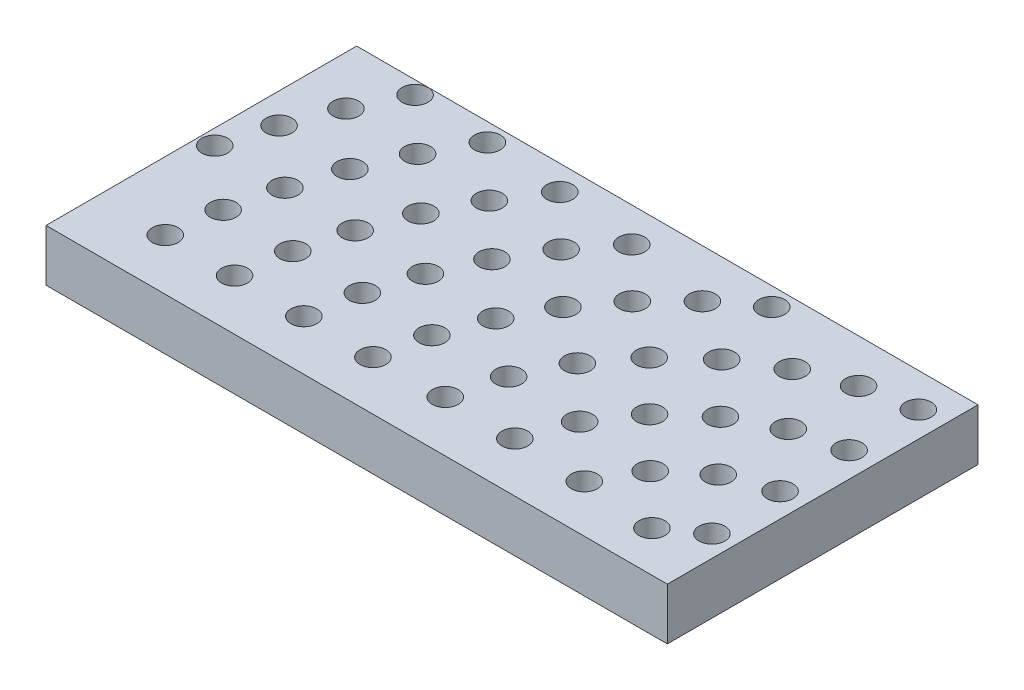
ISO-10303-21;
HEADER;
FILE_DESCRIPTION(('STEP AP214'),'2;1');
FILE_NAME('part.step','',(''),(''),'','','');
FILE_SCHEMA(('AUTOMOTIVE_DESIGN { 1 0 10303 214 1 1 1 1 }'));
ENDSEC;
DATA;
#1=APPLICATION_CONTEXT('core data for automotive mechanical design processes');
#2=APPLICATION_PROTOCOL_DEFINITION('international standard','automotive_design',2000,#1);
#3=PRODUCT_CONTEXT('',#1,'mechanical');
#4=PRODUCT('Part','Part','',(#3));
#5=PRODUCT_RELATED_PRODUCT_CATEGORY('part','',(#4));
#6=PRODUCT_DEFINITION_FORMATION('','',#4);
#7=PRODUCT_DEFINITION_CONTEXT('part definition',#1,'design');
#8=PRODUCT_DEFINITION('design','',#6,#7);
#9=PRODUCT_DEFINITION_SHAPE('','',#8);
#10=(LENGTH_UNIT() NAMED_UNIT(*) SI_UNIT(.MILLI.,.METRE.));
#11=(NAMED_UNIT(*) PLANE_ANGLE_UNIT() SI_UNIT($,.RADIAN.));
#12=(NAMED_UNIT(*) SI_UNIT($,.STERADIAN.) SOLID_ANGLE_UNIT());
#13=UNCERTAINTY_MEASURE_WITH_UNIT(LENGTH_MEASURE(1.E-05),#10,'distance_accuracy_value','');
#14=(GEOMETRIC_REPRESENTATION_CONTEXT(3) GLOBAL_UNCERTAINTY_ASSIGNED_CONTEXT((#13)) GLOBAL_UNIT_ASSIGNED_CONTEXT((#10,
#11,#12)) REPRESENTATION_CONTEXT('',''));
#15=CARTESIAN_POINT('',(0.,0.,0.));
#16=DIRECTION('',(0.,0.,1.));
#17=DIRECTION('',(1.,0.,0.));
#18=AXIS2_PLACEMENT_3D('',#15,#16,#17);
#19=CARTESIAN_POINT('',(-76.2,12.7,-38.1));
#20=DIRECTION('',(1.,0.,0.));
#21=DIRECTION('',(0.,0.,-1.));
#22=AXIS2_PLACEMENT_3D('',#19,#20,#21);
#23=PLANE('',#22);
#24=DIRECTION('',(0.,0.,1.));
#25=VECTOR('',#24,1.);
#26=CARTESIAN_POINT('',(-76.2,0.,-38.1));
#27=LINE('',#26,#25);
#28=CARTESIAN_POINT('',(-76.2,0.,-38.1));
#29=VERTEX_POINT('',#28);
#30=CARTESIAN_POINT('',(-76.2,0.,38.1));
#31=VERTEX_POINT('',#30);
#32=EDGE_CURVE('E96',#29,#31,#27,.T.);
#33=ORIENTED_EDGE('',*,*,#32,.T.);
#34=DIRECTION('',(0.,-1.,0.));
#35=VECTOR('',#34,1.);
#36=CARTESIAN_POINT('',(-76.2,12.7,38.1));
#37=LINE('',#36,#35);
#38=CARTESIAN_POINT('',(-76.2,12.7,38.1));
#39=VERTEX_POINT('',#38);
#40=EDGE_CURVE('E12',#39,#31,#37,.T.);
#41=ORIENTED_EDGE('',*,*,#40,.F.);
#42=DIRECTION('',(0.,0.,1.));
#43=VECTOR('',#42,1.);
#44=CARTESIAN_POINT('',(-76.2,12.7,-38.1));
#45=LINE('',#44,#43);
#46=CARTESIAN_POINT('',(-76.2,12.7,-38.1));
#47=VERTEX_POINT('',#46);
#48=EDGE_CURVE('E84',#47,#39,#45,.T.);
#49=ORIENTED_EDGE('',*,*,#48,.F.);
#50=DIRECTION('',(0.,-1.,0.));
#51=VECTOR('',#50,1.);
#52=CARTESIAN_POINT('',(-76.2,12.7,-38.1));
#53=LINE('',#52,#51);
#54=EDGE_CURVE('E92',#47,#29,#53,.T.);
#55=ORIENTED_EDGE('',*,*,#54,.T.);
#56=EDGE_LOOP('',(#33,#41,#49,#55));
#57=FACE_BOUND('',#56,.T.);
#58=ADVANCED_FACE('F33',(#57),#23,.F.);
#59=CARTESIAN_POINT('',(-76.2,12.7,38.1));
#60=DIRECTION('',(0.,0.,-1.));
#61=DIRECTION('',(-1.,0.,0.));
#62=AXIS2_PLACEMENT_3D('',#59,#60,#61);
#63=PLANE('',#62);
#64=DIRECTION('',(1.,0.,0.));
#65=VECTOR('',#64,1.);
#66=CARTESIAN_POINT('',(-76.2,0.,38.1));
#67=LINE('',#66,#65);
#68=CARTESIAN_POINT('',(76.2,0.,38.1));
#69=VERTEX_POINT('',#68);
#70=EDGE_CURVE('E88',#31,#69,#67,.T.);
#71=ORIENTED_EDGE('',*,*,#70,.T.);
#72=DIRECTION('',(0.,-1.,0.));
#73=VECTOR('',#72,1.);
#74=CARTESIAN_POINT('',(76.2,12.7,38.1));
#75=LINE('',#74,#73);
#76=CARTESIAN_POINT('',(76.2,12.7,38.1));
#77=VERTEX_POINT('',#76);
#78=EDGE_CURVE('E41',#77,#69,#75,.T.);
#79=ORIENTED_EDGE('',*,*,#78,.F.);
#80=DIRECTION('',(1.,0.,0.));
#81=VECTOR('',#80,1.);
#82=CARTESIAN_POINT('',(-76.2,12.7,38.1));
#83=LINE('',#82,#81);
#84=EDGE_CURVE('E79',#39,#77,#83,.T.);
#85=ORIENTED_EDGE('',*,*,#84,.F.);
#86=ORIENTED_EDGE('',*,*,#40,.T.);
#87=EDGE_LOOP('',(#71,#79,#85,#86));
#88=FACE_BOUND('',#87,.T.);
#89=ADVANCED_FACE('F87',(#88),#63,.F.);
#90=CARTESIAN_POINT('',(76.2,12.7,-38.1));
#91=DIRECTION('',(-1.,0.,0.));
#92=DIRECTION('',(0.,0.,1.));
#93=AXIS2_PLACEMENT_3D('',#90,#91,#92);
#94=PLANE('',#93);
#95=DIRECTION('',(0.,0.,-1.));
#96=VECTOR('',#95,1.);
#97=CARTESIAN_POINT('',(76.2,0.,-38.1));
#98=LINE('',#97,#96);
#99=CARTESIAN_POINT('',(76.2,0.,-38.1));
#100=VERTEX_POINT('',#99);
#101=EDGE_CURVE('E66',#69,#100,#98,.T.);
#102=ORIENTED_EDGE('',*,*,#101,.T.);
#103=DIRECTION('',(0.,-1.,0.));
#104=VECTOR('',#103,1.);
#105=CARTESIAN_POINT('',(76.2,12.7,-38.1));
#106=LINE('',#105,#104);
#107=CARTESIAN_POINT('',(76.2,12.7,-38.1));
#108=VERTEX_POINT('',#107);
#109=EDGE_CURVE('E89',#108,#100,#106,.T.);
#110=ORIENTED_EDGE('',*,*,#109,.F.);
#111=DIRECTION('',(0.,0.,-1.));
#112=VECTOR('',#111,1.);
#113=CARTESIAN_POINT('',(76.2,12.7,-38.1));
#114=LINE('',#113,#112);
#115=EDGE_CURVE('E82',#77,#108,#114,.T.);
#116=ORIENTED_EDGE('',*,*,#115,.F.);
#117=ORIENTED_EDGE('',*,*,#78,.T.);
#118=EDGE_LOOP('',(#102,#110,#116,#117));
#119=FACE_BOUND('',#118,.T.);
#120=ADVANCED_FACE('F90',(#119),#94,.F.);
#121=CARTESIAN_POINT('',(-76.2,12.7,-38.1));
#122=DIRECTION('',(0.,0.,1.));
#123=DIRECTION('',(1.,0.,0.));
#124=AXIS2_PLACEMENT_3D('',#121,#122,#123);
#125=PLANE('',#124);
#126=DIRECTION('',(-1.,0.,0.));
#127=VECTOR('',#126,1.);
#128=CARTESIAN_POINT('',(-76.2,0.,-38.1));
#129=LINE('',#128,#127);
#130=EDGE_CURVE('E72',#100,#29,#129,.T.);
#131=ORIENTED_EDGE('',*,*,#130,.T.);
#132=ORIENTED_EDGE('',*,*,#54,.F.);
#133=DIRECTION('',(-1.,0.,0.));
#134=VECTOR('',#133,1.);
#135=CARTESIAN_POINT('',(-76.2,12.7,-38.1));
#136=LINE('',#135,#134);
#137=EDGE_CURVE('E49',#108,#47,#136,.T.);
#138=ORIENTED_EDGE('',*,*,#137,.F.);
#139=ORIENTED_EDGE('',*,*,#109,.T.);
#140=EDGE_LOOP('',(#131,#132,#138,#139));
#141=FACE_BOUND('',#140,.T.);
#142=ADVANCED_FACE('F104',(#141),#125,.F.);
#143=CARTESIAN_POINT('',(-76.2,12.7,38.1));
#144=DIRECTION('',(0.,1.,0.));
#145=DIRECTION('',(0.,0.,1.));
#146=AXIS2_PLACEMENT_3D('',#143,#144,#145);
#147=PLANE('',#146);
#148=CARTESIAN_POINT('',(-58.6668968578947,12.7,-34.8863146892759));
#149=DIRECTION('',(0.,1.,0.));
#150=DIRECTION('',(1.,0.,0.));
#151=AXIS2_PLACEMENT_3D('',#148,#149,#150);
#152=CIRCLE('',#151,3.175);
#153=CARTESIAN_POINT('',(-55.4918968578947,12.7,-34.8863146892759));
#154=VERTEX_POINT('',#153);
#155=EDGE_CURVE('E398',#154,#154,#152,.T.);
#156=ORIENTED_EDGE('',*,*,#155,.F.);
#157=EDGE_LOOP('',(#156));
#158=FACE_BOUND('',#157,.T.);
#159=CARTESIAN_POINT('',(-64.2334201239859,12.7,-23.4998093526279));
#160=DIRECTION('',(0.,1.,0.));
#161=DIRECTION('',(1.,0.,0.));
#162=AXIS2_PLACEMENT_3D('',#159,#160,#161);
#163=CIRCLE('',#162,3.175);
#164=CARTESIAN_POINT('',(-61.0584201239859,12.7,-23.4998093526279));
#165=VERTEX_POINT('',#164);
#166=EDGE_CURVE('E392',#165,#165,#163,.T.);
#167=ORIENTED_EDGE('',*,*,#166,.F.);
#168=EDGE_LOOP('',(#167));
#169=FACE_BOUND('',#168,.T.);
#170=CARTESIAN_POINT('',(-68.8406407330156,12.7,-11.6925148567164));
#171=DIRECTION('',(0.,1.,0.));
#172=DIRECTION('',(1.,0.,0.));
#173=AXIS2_PLACEMENT_3D('',#170,#171,#172);
#174=CIRCLE('',#173,3.175);
#175=CARTESIAN_POINT('',(-65.6656407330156,12.7,-11.6925148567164));
#176=VERTEX_POINT('',#175);
#177=EDGE_CURVE('E386',#176,#176,#174,.T.);
#178=ORIENTED_EDGE('',*,*,#177,.F.);
#179=EDGE_LOOP('',(#178));
#180=FACE_BOUND('',#179,.T.);
#181=CARTESIAN_POINT('',(-72.4570866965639,12.7,0.454913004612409));
#182=DIRECTION('',(0.,1.,0.));
#183=DIRECTION('',(1.,0.,0.));
#184=AXIS2_PLACEMENT_3D('',#181,#182,#183);
#185=CIRCLE('',#184,3.175);
#186=CARTESIAN_POINT('',(-69.2820866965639,12.7,0.454913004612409));
#187=VERTEX_POINT('',#186);
#188=EDGE_CURVE('E380',#187,#187,#185,.T.);
#189=ORIENTED_EDGE('',*,*,#188,.F.);
#190=EDGE_LOOP('',(#189));
#191=FACE_BOUND('',#190,.T.);
#192=CARTESIAN_POINT('',(-39.6936962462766,12.7,-33.6583386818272));
#193=DIRECTION('',(0.,1.,0.));
#194=DIRECTION('',(1.,0.,0.));
#195=AXIS2_PLACEMENT_3D('',#192,#193,#194);
#196=CIRCLE('',#195,3.175);
#197=CARTESIAN_POINT('',(-36.5186962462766,12.7,-33.6583386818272));
#198=VERTEX_POINT('',#197);
#199=EDGE_CURVE('E374',#198,#198,#196,.T.);
#200=ORIENTED_EDGE('',*,*,#199,.F.);
#201=EDGE_LOOP('',(#200));
#202=FACE_BOUND('',#201,.T.);
#203=CARTESIAN_POINT('',(-45.8203383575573,12.7,-22.6589090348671));
#204=DIRECTION('',(0.,1.,0.));
#205=DIRECTION('',(1.,0.,0.));
#206=AXIS2_PLACEMENT_3D('',#203,#204,#205);
#207=CIRCLE('',#206,3.175);
#208=CARTESIAN_POINT('',(-42.6453383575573,12.7,-22.6589090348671));
#209=VERTEX_POINT('',#208);
#210=EDGE_CURVE('E368',#209,#209,#207,.T.);
#211=ORIENTED_EDGE('',*,*,#210,.F.);
#212=EDGE_LOOP('',(#211));
#213=FACE_BOUND('',#212,.T.);
#214=CARTESIAN_POINT('',(-50.9059459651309,12.7,-11.1411057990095));
#215=DIRECTION('',(0.,1.,0.));
#216=DIRECTION('',(1.,0.,0.));
#217=AXIS2_PLACEMENT_3D('',#214,#215,#216);
#218=CIRCLE('',#217,3.175);
#219=CARTESIAN_POINT('',(-47.7309459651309,12.7,-11.1411057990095));
#220=VERTEX_POINT('',#219);
#221=EDGE_CURVE('E362',#220,#220,#218,.T.);
#222=ORIENTED_EDGE('',*,*,#221,.F.);
#223=EDGE_LOOP('',(#222));
#224=FACE_BOUND('',#223,.T.);
#225=CARTESIAN_POINT('',(-54.9071304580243,12.7,0.796805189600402));
#226=DIRECTION('',(0.,1.,0.));
#227=DIRECTION('',(1.,0.,0.));
#228=AXIS2_PLACEMENT_3D('',#225,#226,#227);
#229=CIRCLE('',#228,3.175);
#230=CARTESIAN_POINT('',(-51.7321304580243,12.7,0.796805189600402));
#231=VERTEX_POINT('',#230);
#232=EDGE_CURVE('E356',#231,#231,#229,.T.);
#233=ORIENTED_EDGE('',*,*,#232,.F.);
#234=EDGE_LOOP('',(#233));
#235=FACE_BOUND('',#234,.T.);
#236=CARTESIAN_POINT('',(-57.789755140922,12.7,13.0529738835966));
#237=DIRECTION('',(0.,1.,0.));
#238=DIRECTION('',(1.,0.,0.));
#239=AXIS2_PLACEMENT_3D('',#236,#237,#238);
#240=CIRCLE('',#239,3.175);
#241=CARTESIAN_POINT('',(-54.614755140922,12.7,13.0529738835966));
#242=VERTEX_POINT('',#241);
#243=EDGE_CURVE('E350',#242,#242,#240,.T.);
#244=ORIENTED_EDGE('',*,*,#243,.F.);
#245=EDGE_LOOP('',(#244));
#246=FACE_BOUND('',#245,.T.);
#247=CARTESIAN_POINT('',(-20.2929664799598,12.7,-32.0062438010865));
#248=DIRECTION('',(0.,1.,0.));
#249=DIRECTION('',(1.,0.,0.));
#250=AXIS2_PLACEMENT_3D('',#247,#248,#249);
#251=CIRCLE('',#250,3.175);
#252=CARTESIAN_POINT('',(-17.1179664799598,12.7,-32.0062438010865));
#253=VERTEX_POINT('',#252);
#254=EDGE_CURVE('E344',#253,#253,#251,.T.);
#255=ORIENTED_EDGE('',*,*,#254,.F.);
#256=EDGE_LOOP('',(#255));
#257=FACE_BOUND('',#256,.T.);
#258=CARTESIAN_POINT('',(-59.5292264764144,12.7,25.5228349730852));
#259=DIRECTION('',(0.,1.,0.));
#260=DIRECTION('',(1.,0.,0.));
#261=AXIS2_PLACEMENT_3D('',#258,#259,#260);
#262=CIRCLE('',#261,3.175);
#263=CARTESIAN_POINT('',(-56.3542264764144,12.7,25.5228349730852));
#264=VERTEX_POINT('',#263);
#265=EDGE_CURVE('E338',#264,#264,#262,.T.);
#266=ORIENTED_EDGE('',*,*,#265,.F.);
#267=EDGE_LOOP('',(#266));
#268=FACE_BOUND('',#267,.T.);
#269=CARTESIAN_POINT('',(-27.0924658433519,12.7,-21.5359329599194));
#270=DIRECTION('',(0.,1.,0.));
#271=DIRECTION('',(1.,0.,0.));
#272=AXIS2_PLACEMENT_3D('',#269,#270,#271);
#273=CIRCLE('',#272,3.175);
#274=CARTESIAN_POINT('',(-23.9174658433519,12.7,-21.5359329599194));
#275=VERTEX_POINT('',#274);
#276=EDGE_CURVE('E332',#275,#275,#273,.T.);
#277=ORIENTED_EDGE('',*,*,#276,.F.);
#278=EDGE_LOOP('',(#277));
#279=FACE_BOUND('',#278,.T.);
#280=CARTESIAN_POINT('',(-32.7602713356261,12.7,-10.4122383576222));
#281=DIRECTION('',(0.,1.,0.));
#282=DIRECTION('',(1.,0.,0.));
#283=AXIS2_PLACEMENT_3D('',#280,#281,#282);
#284=CIRCLE('',#283,3.175);
#285=CARTESIAN_POINT('',(-29.5852713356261,12.7,-10.4122383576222));
#286=VERTEX_POINT('',#285);
#287=EDGE_CURVE('E326',#286,#286,#284,.T.);
#288=ORIENTED_EDGE('',*,*,#287,.F.);
#289=EDGE_LOOP('',(#288));
#290=FACE_BOUND('',#289,.T.);
#291=CARTESIAN_POINT('',(-37.2342852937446,12.7,1.24296647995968));
#292=DIRECTION('',(0.,1.,0.));
#293=DIRECTION('',(1.,0.,0.));
#294=AXIS2_PLACEMENT_3D('',#291,#292,#293);
#295=CIRCLE('',#294,3.175);
#296=CARTESIAN_POINT('',(-34.0592852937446,12.7,1.24296647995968));
#297=VERTEX_POINT('',#296);
#298=EDGE_CURVE('E320',#297,#297,#295,.T.);
#299=ORIENTED_EDGE('',*,*,#298,.F.);
#300=EDGE_LOOP('',(#299));
#301=FACE_BOUND('',#300,.T.);
#302=CARTESIAN_POINT('',(-40.4654894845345,12.7,13.3019846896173));
#303=DIRECTION('',(0.,1.,0.));
#304=DIRECTION('',(1.,0.,0.));
#305=AXIS2_PLACEMENT_3D('',#302,#303,#304);
#306=CIRCLE('',#305,3.175);
#307=CARTESIAN_POINT('',(-37.2904894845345,12.7,13.3019846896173));
#308=VERTEX_POINT('',#307);
#309=EDGE_CURVE('E314',#308,#308,#306,.T.);
#310=ORIENTED_EDGE('',*,*,#309,.F.);
#311=EDGE_LOOP('',(#310));
#312=FACE_BOUND('',#311,.T.);
#313=CARTESIAN_POINT('',(-0.32252022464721,12.7,-29.6930372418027));
#314=DIRECTION('',(0.,1.,0.));
#315=DIRECTION('',(1.,0.,0.));
#316=AXIS2_PLACEMENT_3D('',#313,#314,#315);
#317=CIRCLE('',#316,3.175);
#318=CARTESIAN_POINT('',(2.85247977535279,12.7,-29.6930372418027));
#319=VERTEX_POINT('',#318);
#320=EDGE_CURVE('E308',#319,#319,#317,.T.);
#321=ORIENTED_EDGE('',*,*,#320,.F.);
#322=EDGE_LOOP('',(#321));
#323=FACE_BOUND('',#322,.T.);
#324=CARTESIAN_POINT('',(-42.4184821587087,12.7,25.6326951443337));
#325=DIRECTION('',(0.,1.,0.));
#326=DIRECTION('',(1.,0.,0.));
#327=AXIS2_PLACEMENT_3D('',#324,#325,#326);
#328=CIRCLE('',#327,3.175);
#329=CARTESIAN_POINT('',(-39.2434821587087,12.7,25.6326951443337));
#330=VERTEX_POINT('',#329);
#331=EDGE_CURVE('E302',#330,#330,#328,.T.);
#332=ORIENTED_EDGE('',*,*,#331,.F.);
#333=EDGE_LOOP('',(#332));
#334=FACE_BOUND('',#333,.T.);
#335=CARTESIAN_POINT('',(-7.93613254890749,12.7,-19.9749791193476));
#336=DIRECTION('',(0.,1.,0.));
#337=DIRECTION('',(1.,0.,0.));
#338=AXIS2_PLACEMENT_3D('',#335,#336,#337);
#339=CIRCLE('',#338,3.175);
#340=CARTESIAN_POINT('',(-4.76113254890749,12.7,-19.9749791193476));
#341=VERTEX_POINT('',#340);
#342=EDGE_CURVE('E296',#341,#341,#339,.T.);
#343=ORIENTED_EDGE('',*,*,#342,.F.);
#344=EDGE_LOOP('',(#343));
#345=FACE_BOUND('',#344,.T.);
#346=CARTESIAN_POINT('',(-14.322850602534,12.7,-9.41005702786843));
#347=DIRECTION('',(0.,1.,0.));
#348=DIRECTION('',(1.,0.,0.));
#349=AXIS2_PLACEMENT_3D('',#346,#347,#348);
#350=CIRCLE('',#349,3.175);
#351=CARTESIAN_POINT('',(-11.147850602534,12.7,-9.41005702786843));
#352=VERTEX_POINT('',#351);
#353=EDGE_CURVE('E290',#352,#352,#350,.T.);
#354=ORIENTED_EDGE('',*,*,#353,.F.);
#355=EDGE_LOOP('',(#354));
#356=FACE_BOUND('',#355,.T.);
#357=CARTESIAN_POINT('',(-19.3895416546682,12.7,1.84766867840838));
#358=DIRECTION('',(0.,1.,0.));
#359=DIRECTION('',(1.,0.,0.));
#360=AXIS2_PLACEMENT_3D('',#357,#358,#359);
#361=CIRCLE('',#360,3.175);
#362=CARTESIAN_POINT('',(-16.2145416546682,12.7,1.84766867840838));
#363=VERTEX_POINT('',#362);
#364=EDGE_CURVE('E284',#363,#363,#361,.T.);
#365=ORIENTED_EDGE('',*,*,#364,.F.);
#366=EDGE_LOOP('',(#365));
#367=FACE_BOUND('',#366,.T.);
#368=CARTESIAN_POINT('',(30.1405435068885,12.7,-33.5699132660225));
#369=DIRECTION('',(0.,1.,0.));
#370=DIRECTION('',(1.,0.,0.));
#371=AXIS2_PLACEMENT_3D('',#368,#369,#370);
#372=CIRCLE('',#371,3.175);
#373=CARTESIAN_POINT('',(33.3155435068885,12.7,-33.5699132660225));
#374=VERTEX_POINT('',#373);
#375=EDGE_CURVE('E278',#374,#374,#372,.T.);
#376=ORIENTED_EDGE('',*,*,#375,.F.);
#377=EDGE_LOOP('',(#376));
#378=FACE_BOUND('',#377,.T.);
#379=CARTESIAN_POINT('',(-23.0623219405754,12.7,13.6340350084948));
#380=DIRECTION('',(0.,1.,0.));
#381=DIRECTION('',(1.,0.,0.));
#382=AXIS2_PLACEMENT_3D('',#379,#380,#381);
#383=CIRCLE('',#382,3.175);
#384=CARTESIAN_POINT('',(-19.8873219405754,12.7,13.6340350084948));
#385=VERTEX_POINT('',#384);
#386=EDGE_CURVE('E272',#385,#385,#383,.T.);
#387=ORIENTED_EDGE('',*,*,#386,.F.);
#388=EDGE_LOOP('',(#387));
#389=FACE_BOUND('',#388,.T.);
#390=CARTESIAN_POINT('',(20.4096702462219,12.7,-26.2854727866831));
#391=DIRECTION('',(0.,1.,0.));
#392=DIRECTION('',(1.,0.,0.));
#393=AXIS2_PLACEMENT_3D('',#390,#391,#392);
#394=CIRCLE('',#393,3.175);
#395=CARTESIAN_POINT('',(23.584670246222,12.7,-26.2854727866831));
#396=VERTEX_POINT('',#395);
#397=EDGE_CURVE('E266',#396,#396,#394,.T.);
#398=ORIENTED_EDGE('',*,*,#397,.F.);
#399=EDGE_LOOP('',(#398));
#400=FACE_BOUND('',#399,.T.);
#401=CARTESIAN_POINT('',(-25.2876340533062,12.7,25.7771702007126));
#402=DIRECTION('',(0.,1.,0.));
#403=DIRECTION('',(1.,0.,0.));
#404=AXIS2_PLACEMENT_3D('',#401,#402,#403);
#405=CIRCLE('',#404,3.175);
#406=CARTESIAN_POINT('',(-22.1126340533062,12.7,25.7771702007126));
#407=VERTEX_POINT('',#406);
#408=EDGE_CURVE('E260',#407,#407,#405,.T.);
#409=ORIENTED_EDGE('',*,*,#408,.F.);
#410=EDGE_LOOP('',(#409));
#411=FACE_BOUND('',#410,.T.);
#412=CARTESIAN_POINT('',(11.8145272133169,12.7,-17.6903297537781));
#413=DIRECTION('',(0.,1.,0.));
#414=DIRECTION('',(1.,0.,0.));
#415=AXIS2_PLACEMENT_3D('',#412,#413,#414);
#416=CIRCLE('',#415,3.175);
#417=CARTESIAN_POINT('',(14.9895272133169,12.7,-17.6903297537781));
#418=VERTEX_POINT('',#417);
#419=EDGE_CURVE('E254',#418,#418,#416,.T.);
#420=ORIENTED_EDGE('',*,*,#419,.F.);
#421=EDGE_LOOP('',(#420));
#422=FACE_BOUND('',#421,.T.);
#423=CARTESIAN_POINT('',(4.53008673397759,12.7,-7.95945649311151));
#424=DIRECTION('',(0.,1.,0.));
#425=DIRECTION('',(1.,0.,0.));
#426=AXIS2_PLACEMENT_3D('',#423,#424,#425);
#427=CIRCLE('',#426,3.175);
#428=CARTESIAN_POINT('',(7.70508673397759,12.7,-7.95945649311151));
#429=VERTEX_POINT('',#428);
#430=EDGE_CURVE('E248',#429,#429,#427,.T.);
#431=ORIENTED_EDGE('',*,*,#430,.F.);
#432=EDGE_LOOP('',(#431));
#433=FACE_BOUND('',#432,.T.);
#434=CARTESIAN_POINT('',(-1.29536099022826,12.7,2.7090544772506));
#435=DIRECTION('',(0.,1.,0.));
#436=DIRECTION('',(1.,0.,0.));
#437=AXIS2_PLACEMENT_3D('',#434,#435,#436);
#438=CIRCLE('',#437,3.175);
#439=CARTESIAN_POINT('',(1.87963900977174,12.7,2.7090544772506));
#440=VERTEX_POINT('',#439);
#441=EDGE_CURVE('E242',#440,#440,#438,.T.);
#442=ORIENTED_EDGE('',*,*,#441,.F.);
#443=EDGE_LOOP('',(#442));
#444=FACE_BOUND('',#443,.T.);
#445=CARTESIAN_POINT('',(69.9114174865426,12.7,-29.7646132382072));
#446=DIRECTION('',(0.,1.,0.));
#447=DIRECTION('',(1.,0.,0.));
#448=AXIS2_PLACEMENT_3D('',#445,#446,#447);
#449=CIRCLE('',#448,3.175);
#450=CARTESIAN_POINT('',(73.0864174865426,12.7,-29.7646132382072));
#451=VERTEX_POINT('',#450);
#452=EDGE_CURVE('E236',#451,#451,#449,.T.);
#453=ORIENTED_EDGE('',*,*,#452,.F.);
#454=EDGE_LOOP('',(#453));
#455=FACE_BOUND('',#454,.T.);
#456=CARTESIAN_POINT('',(-5.54322664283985,12.7,14.0980230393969));
#457=DIRECTION('',(0.,1.,0.));
#458=DIRECTION('',(1.,0.,0.));
#459=AXIS2_PLACEMENT_3D('',#456,#457,#458);
#460=CIRCLE('',#459,3.175);
#461=CARTESIAN_POINT('',(-2.36822664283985,12.7,14.0980230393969));
#462=VERTEX_POINT('',#461);
#463=EDGE_CURVE('E230',#462,#462,#460,.T.);
#464=ORIENTED_EDGE('',*,*,#463,.F.);
#465=EDGE_LOOP('',(#464));
#466=FACE_BOUND('',#465,.T.);
#467=CARTESIAN_POINT('',(57.5484025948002,12.7,-27.4535652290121));
#468=DIRECTION('',(0.,1.,0.));
#469=DIRECTION('',(1.,0.,0.));
#470=AXIS2_PLACEMENT_3D('',#467,#468,#469);
#471=CIRCLE('',#470,3.175);
#472=CARTESIAN_POINT('',(60.7234025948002,12.7,-27.4535652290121));
#473=VERTEX_POINT('',#472);
#474=EDGE_CURVE('E224',#473,#473,#471,.T.);
#475=ORIENTED_EDGE('',*,*,#474,.F.);
#476=EDGE_LOOP('',(#475));
#477=FACE_BOUND('',#476,.T.);
#478=CARTESIAN_POINT('',(-8.12703592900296,12.7,25.9756026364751));
#479=DIRECTION('',(0.,1.,0.));
#480=DIRECTION('',(1.,0.,0.));
#481=AXIS2_PLACEMENT_3D('',#478,#479,#480);
#482=CIRCLE('',#481,3.175);
#483=CARTESIAN_POINT('',(-4.95203592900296,12.7,25.9756026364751));
#484=VERTEX_POINT('',#483);
#485=EDGE_CURVE('E218',#484,#484,#482,.T.);
#486=ORIENTED_EDGE('',*,*,#485,.F.);
#487=EDGE_LOOP('',(#486));
#488=FACE_BOUND('',#487,.T.);
#489=CARTESIAN_POINT('',(45.8205454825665,12.7,-22.9101691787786));
#490=DIRECTION('',(0.,1.,0.));
#491=DIRECTION('',(1.,0.,0.));
#492=AXIS2_PLACEMENT_3D('',#489,#490,#491);
#493=CIRCLE('',#492,3.175);
#494=CARTESIAN_POINT('',(48.9955454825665,12.7,-22.9101691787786));
#495=VERTEX_POINT('',#494);
#496=EDGE_CURVE('E212',#495,#495,#493,.T.);
#497=ORIENTED_EDGE('',*,*,#496,.F.);
#498=EDGE_LOOP('',(#497));
#499=FACE_BOUND('',#498,.T.);
#500=CARTESIAN_POINT('',(35.1272242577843,12.7,-16.2891449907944));
#501=DIRECTION('',(0.,1.,0.));
#502=DIRECTION('',(1.,0.,0.));
#503=AXIS2_PLACEMENT_3D('',#500,#501,#502);
#504=CIRCLE('',#503,3.175);
#505=CARTESIAN_POINT('',(38.3022242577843,12.7,-16.2891449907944));
#506=VERTEX_POINT('',#505);
#507=EDGE_CURVE('E206',#506,#506,#504,.T.);
#508=ORIENTED_EDGE('',*,*,#507,.F.);
#509=EDGE_LOOP('',(#508));
#510=FACE_BOUND('',#509,.T.);
#511=CARTESIAN_POINT('',(25.8325871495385,12.7,-7.81596370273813));
#512=DIRECTION('',(0.,1.,0.));
#513=DIRECTION('',(1.,0.,0.));
#514=AXIS2_PLACEMENT_3D('',#511,#512,#513);
#515=CIRCLE('',#514,3.175);
#516=CARTESIAN_POINT('',(29.0075871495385,12.7,-7.81596370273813));
#517=VERTEX_POINT('',#516);
#518=EDGE_CURVE('E200',#517,#517,#515,.T.);
#519=ORIENTED_EDGE('',*,*,#518,.F.);
#520=EDGE_LOOP('',(#519));
#521=FACE_BOUND('',#520,.T.);
#522=CARTESIAN_POINT('',(18.2531518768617,12.7,2.22083065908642));
#523=DIRECTION('',(0.,1.,0.));
#524=DIRECTION('',(1.,0.,0.));
#525=AXIS2_PLACEMENT_3D('',#522,#523,#524);
#526=CIRCLE('',#525,3.175);
#527=CARTESIAN_POINT('',(21.4281518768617,12.7,2.22083065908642));
#528=VERTEX_POINT('',#527);
#529=EDGE_CURVE('E194',#528,#528,#526,.T.);
#530=ORIENTED_EDGE('',*,*,#529,.F.);
#531=EDGE_LOOP('',(#530));
#532=FACE_BOUND('',#531,.T.);
#533=CARTESIAN_POINT('',(12.6470270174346,12.7,13.4794471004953));
#534=DIRECTION('',(0.,1.,0.));
#535=DIRECTION('',(1.,0.,0.));
#536=AXIS2_PLACEMENT_3D('',#533,#534,#535);
#537=CIRCLE('',#536,3.175);
#538=CARTESIAN_POINT('',(15.8220270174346,12.7,13.4794471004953));
#539=VERTEX_POINT('',#538);
#540=EDGE_CURVE('E188',#539,#539,#537,.T.);
#541=ORIENTED_EDGE('',*,*,#540,.F.);
#542=EDGE_LOOP('',(#541));
#543=FACE_BOUND('',#542,.T.);
#544=CARTESIAN_POINT('',(70.0385851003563,12.7,-12.6438170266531));
#545=DIRECTION('',(0.,1.,0.));
#546=DIRECTION('',(1.,0.,0.));
#547=AXIS2_PLACEMENT_3D('',#544,#545,#546);
#548=CIRCLE('',#547,3.175);
#549=CARTESIAN_POINT('',(73.2135851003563,12.7,-12.6438170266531));
#550=VERTEX_POINT('',#549);
#551=EDGE_CURVE('E182',#550,#550,#548,.T.);
#552=ORIENTED_EDGE('',*,*,#551,.F.);
#553=EDGE_LOOP('',(#552));
#554=FACE_BOUND('',#553,.T.);
#555=CARTESIAN_POINT('',(9.20512242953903,12.7,25.5764869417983));
#556=DIRECTION('',(0.,1.,0.));
#557=DIRECTION('',(1.,0.,0.));
#558=AXIS2_PLACEMENT_3D('',#555,#556,#557);
#559=CIRCLE('',#558,3.175);
#560=CARTESIAN_POINT('',(12.380122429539,12.7,25.5764869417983));
#561=VERTEX_POINT('',#560);
#562=EDGE_CURVE('E176',#561,#561,#559,.T.);
#563=ORIENTED_EDGE('',*,*,#562,.F.);
#564=EDGE_LOOP('',(#563));
#565=FACE_BOUND('',#564,.T.);
#566=CARTESIAN_POINT('',(58.0738343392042,12.7,-9.69477082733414));
#567=DIRECTION('',(0.,1.,0.));
#568=DIRECTION('',(1.,0.,0.));
#569=AXIS2_PLACEMENT_3D('',#566,#567,#568);
#570=CIRCLE('',#569,3.175);
#571=CARTESIAN_POINT('',(61.2488343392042,12.7,-9.69477082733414));
#572=VERTEX_POINT('',#571);
#573=EDGE_CURVE('E170',#572,#572,#570,.T.);
#574=ORIENTED_EDGE('',*,*,#573,.F.);
#575=EDGE_LOOP('',(#574));
#576=FACE_BOUND('',#575,.T.);
#577=CARTESIAN_POINT('',(47.1625104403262,12.7,-3.96806627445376));
#578=DIRECTION('',(0.,1.,0.));
#579=DIRECTION('',(1.,0.,0.));
#580=AXIS2_PLACEMENT_3D('',#577,#578,#579);
#581=CIRCLE('',#580,3.175);
#582=CARTESIAN_POINT('',(50.3375104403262,12.7,-3.96806627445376));
#583=VERTEX_POINT('',#582);
#584=EDGE_CURVE('E164',#583,#583,#581,.T.);
#585=ORIENTED_EDGE('',*,*,#584,.F.);
#586=EDGE_LOOP('',(#585));
#587=FACE_BOUND('',#586,.T.);
#588=CARTESIAN_POINT('',(37.9387398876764,12.7,4.20348137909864));
#589=DIRECTION('',(0.,1.,0.));
#590=DIRECTION('',(1.,0.,0.));
#591=AXIS2_PLACEMENT_3D('',#588,#589,#590);
#592=CIRCLE('',#591,3.175);
#593=CARTESIAN_POINT('',(41.1137398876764,12.7,4.20348137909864));
#594=VERTEX_POINT('',#593);
#595=EDGE_CURVE('E158',#594,#594,#592,.T.);
#596=ORIENTED_EDGE('',*,*,#595,.F.);
#597=EDGE_LOOP('',(#596));
#598=FACE_BOUND('',#597,.T.);
#599=CARTESIAN_POINT('',(30.938574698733,12.7,14.3449714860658));
#600=DIRECTION('',(0.,1.,0.));
#601=DIRECTION('',(1.,0.,0.));
#602=AXIS2_PLACEMENT_3D('',#599,#600,#601);
#603=CIRCLE('',#602,3.175);
#604=CARTESIAN_POINT('',(34.113574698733,12.7,14.3449714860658));
#605=VERTEX_POINT('',#604);
#606=EDGE_CURVE('E152',#605,#605,#603,.T.);
#607=ORIENTED_EDGE('',*,*,#606,.F.);
#608=EDGE_LOOP('',(#607));
#609=FACE_BOUND('',#608,.T.);
#610=CARTESIAN_POINT('',(26.5688390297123,12.7,25.8670175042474));
#611=DIRECTION('',(0.,1.,0.));
#612=DIRECTION('',(1.,0.,0.));
#613=AXIS2_PLACEMENT_3D('',#610,#611,#612);
#614=CIRCLE('',#613,3.175);
#615=CARTESIAN_POINT('',(29.7438390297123,12.7,25.8670175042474));
#616=VERTEX_POINT('',#615);
#617=EDGE_CURVE('E146',#616,#616,#614,.T.);
#618=ORIENTED_EDGE('',*,*,#617,.F.);
#619=EDGE_LOOP('',(#618));
#620=FACE_BOUND('',#619,.T.);
#621=CARTESIAN_POINT('',(70.282473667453,12.7,4.54004049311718));
#622=DIRECTION('',(0.,1.,0.));
#623=DIRECTION('',(1.,0.,0.));
#624=AXIS2_PLACEMENT_3D('',#621,#622,#623);
#625=CIRCLE('',#624,3.175);
#626=CARTESIAN_POINT('',(73.457473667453,12.7,4.54004049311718));
#627=VERTEX_POINT('',#626);
#628=EDGE_CURVE('E140',#627,#627,#625,.T.);
#629=ORIENTED_EDGE('',*,*,#628,.F.);
#630=EDGE_LOOP('',(#629));
#631=FACE_BOUND('',#630,.T.);
#632=CARTESIAN_POINT('',(59.1611620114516,12.7,8.58786690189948));
#633=DIRECTION('',(0.,1.,0.));
#634=DIRECTION('',(1.,0.,0.));
#635=AXIS2_PLACEMENT_3D('',#632,#633,#634);
#636=CIRCLE('',#635,3.175);
#637=CARTESIAN_POINT('',(62.3361620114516,12.7,8.58786690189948));
#638=VERTEX_POINT('',#637);
#639=EDGE_CURVE('E134',#638,#638,#636,.T.);
#640=ORIENTED_EDGE('',*,*,#639,.F.);
#641=EDGE_LOOP('',(#640));
#642=FACE_BOUND('',#641,.T.);
#643=CARTESIAN_POINT('',(50.0949856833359,12.7,16.1952921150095));
#644=DIRECTION('',(0.,1.,0.));
#645=DIRECTION('',(1.,0.,0.));
#646=AXIS2_PLACEMENT_3D('',#643,#644,#645);
#647=CIRCLE('',#646,3.175);
#648=CARTESIAN_POINT('',(53.2699856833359,12.7,16.1952921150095));
#649=VERTEX_POINT('',#648);
#650=EDGE_CURVE('E128',#649,#649,#647,.T.);
#651=ORIENTED_EDGE('',*,*,#650,.F.);
#652=EDGE_LOOP('',(#651));
#653=FACE_BOUND('',#652,.T.);
#654=CARTESIAN_POINT('',(44.1774593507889,12.7,26.4447483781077));
#655=DIRECTION('',(0.,1.,0.));
#656=DIRECTION('',(1.,0.,0.));
#657=AXIS2_PLACEMENT_3D('',#654,#655,#656);
#658=CIRCLE('',#657,3.175);
#659=CARTESIAN_POINT('',(47.3524593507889,12.7,26.4447483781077));
#660=VERTEX_POINT('',#659);
#661=EDGE_CURVE('E122',#660,#660,#658,.T.);
#662=ORIENTED_EDGE('',*,*,#661,.F.);
#663=EDGE_LOOP('',(#662));
#664=FACE_BOUND('',#663,.T.);
#665=CARTESIAN_POINT('',(70.9347094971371,12.7,21.8951021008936));
#666=DIRECTION('',(0.,1.,0.));
#667=DIRECTION('',(1.,0.,0.));
#668=AXIS2_PLACEMENT_3D('',#665,#666,#667);
#669=CIRCLE('',#668,3.175);
#670=CARTESIAN_POINT('',(74.1097094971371,12.7,21.8951021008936));
#671=VERTEX_POINT('',#670);
#672=EDGE_CURVE('E116',#671,#671,#669,.T.);
#673=ORIENTED_EDGE('',*,*,#672,.F.);
#674=EDGE_LOOP('',(#673));
#675=FACE_BOUND('',#674,.T.);
#676=CARTESIAN_POINT('',(62.4152905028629,12.7,28.0848223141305));
#677=DIRECTION('',(0.,1.,0.));
#678=DIRECTION('',(1.,0.,0.));
#679=AXIS2_PLACEMENT_3D('',#676,#677,#678);
#680=CIRCLE('',#679,3.175);
#681=CARTESIAN_POINT('',(65.5902905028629,12.7,28.0848223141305));
#682=VERTEX_POINT('',#681);
#683=EDGE_CURVE('E110',#682,#682,#680,.T.);
#684=ORIENTED_EDGE('',*,*,#683,.F.);
#685=EDGE_LOOP('',(#684));
#686=FACE_BOUND('',#685,.T.);
#687=ORIENTED_EDGE('',*,*,#48,.T.);
#688=ORIENTED_EDGE('',*,*,#84,.T.);
#689=ORIENTED_EDGE('',*,*,#115,.T.);
#690=ORIENTED_EDGE('',*,*,#137,.T.);
#691=EDGE_LOOP('',(#687,#688,#689,#690));
#692=FACE_BOUND('',#691,.T.);
#693=ADVANCED_FACE('F80',(#158,#169,#180,#191,#202,#213,#224,#235,#246,#257,#268,#279,#290,#301,
#312,#323,#334,#345,#356,#367,#378,#389,#400,#411,#422,#433,#444,#455,#466,#477,#488,#499,#510,
#521,#532,#543,#554,#565,#576,#587,#598,#609,#620,#631,#642,#653,#664,#675,#686,#692),#147,.T.);
#694=CARTESIAN_POINT('',(-76.2,0.,38.1));
#695=DIRECTION('',(0.,1.,0.));
#696=DIRECTION('',(0.,0.,1.));
#697=AXIS2_PLACEMENT_3D('',#694,#695,#696);
#698=PLANE('',#697);
#699=CARTESIAN_POINT('',(-58.6668968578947,0.,-34.8863146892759));
#700=DIRECTION('',(0.,1.,0.));
#701=DIRECTION('',(1.,0.,0.));
#702=AXIS2_PLACEMENT_3D('',#699,#700,#701);
#703=CIRCLE('',#702,3.175);
#704=CARTESIAN_POINT('',(-55.4918968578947,0.,-34.8863146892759));
#705=VERTEX_POINT('',#704);
#706=EDGE_CURVE('E395',#705,#705,#703,.T.);
#707=ORIENTED_EDGE('',*,*,#706,.T.);
#708=EDGE_LOOP('',(#707));
#709=FACE_BOUND('',#708,.T.);
#710=CARTESIAN_POINT('',(-64.2334201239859,0.,-23.4998093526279));
#711=DIRECTION('',(0.,1.,0.));
#712=DIRECTION('',(1.,0.,0.));
#713=AXIS2_PLACEMENT_3D('',#710,#711,#712);
#714=CIRCLE('',#713,3.175);
#715=CARTESIAN_POINT('',(-61.0584201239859,0.,-23.4998093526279));
#716=VERTEX_POINT('',#715);
#717=EDGE_CURVE('E389',#716,#716,#714,.T.);
#718=ORIENTED_EDGE('',*,*,#717,.T.);
#719=EDGE_LOOP('',(#718));
#720=FACE_BOUND('',#719,.T.);
#721=CARTESIAN_POINT('',(-68.8406407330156,0.,-11.6925148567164));
#722=DIRECTION('',(0.,1.,0.));
#723=DIRECTION('',(1.,0.,0.));
#724=AXIS2_PLACEMENT_3D('',#721,#722,#723);
#725=CIRCLE('',#724,3.175);
#726=CARTESIAN_POINT('',(-65.6656407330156,0.,-11.6925148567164));
#727=VERTEX_POINT('',#726);
#728=EDGE_CURVE('E383',#727,#727,#725,.T.);
#729=ORIENTED_EDGE('',*,*,#728,.T.);
#730=EDGE_LOOP('',(#729));
#731=FACE_BOUND('',#730,.T.);
#732=CARTESIAN_POINT('',(-72.4570866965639,0.,0.454913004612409));
#733=DIRECTION('',(0.,1.,0.));
#734=DIRECTION('',(1.,0.,0.));
#735=AXIS2_PLACEMENT_3D('',#732,#733,#734);
#736=CIRCLE('',#735,3.175);
#737=CARTESIAN_POINT('',(-69.2820866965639,0.,0.454913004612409));
#738=VERTEX_POINT('',#737);
#739=EDGE_CURVE('E377',#738,#738,#736,.T.);
#740=ORIENTED_EDGE('',*,*,#739,.T.);
#741=EDGE_LOOP('',(#740));
#742=FACE_BOUND('',#741,.T.);
#743=CARTESIAN_POINT('',(-39.6936962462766,0.,-33.6583386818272));
#744=DIRECTION('',(0.,1.,0.));
#745=DIRECTION('',(1.,0.,0.));
#746=AXIS2_PLACEMENT_3D('',#743,#744,#745);
#747=CIRCLE('',#746,3.175);
#748=CARTESIAN_POINT('',(-36.5186962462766,0.,-33.6583386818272));
#749=VERTEX_POINT('',#748);
#750=EDGE_CURVE('E371',#749,#749,#747,.T.);
#751=ORIENTED_EDGE('',*,*,#750,.T.);
#752=EDGE_LOOP('',(#751));
#753=FACE_BOUND('',#752,.T.);
#754=CARTESIAN_POINT('',(-45.8203383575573,0.,-22.6589090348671));
#755=DIRECTION('',(0.,1.,0.));
#756=DIRECTION('',(1.,0.,0.));
#757=AXIS2_PLACEMENT_3D('',#754,#755,#756);
#758=CIRCLE('',#757,3.175);
#759=CARTESIAN_POINT('',(-42.6453383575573,0.,-22.6589090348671));
#760=VERTEX_POINT('',#759);
#761=EDGE_CURVE('E365',#760,#760,#758,.T.);
#762=ORIENTED_EDGE('',*,*,#761,.T.);
#763=EDGE_LOOP('',(#762));
#764=FACE_BOUND('',#763,.T.);
#765=CARTESIAN_POINT('',(-50.9059459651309,0.,-11.1411057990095));
#766=DIRECTION('',(0.,1.,0.));
#767=DIRECTION('',(1.,0.,0.));
#768=AXIS2_PLACEMENT_3D('',#765,#766,#767);
#769=CIRCLE('',#768,3.175);
#770=CARTESIAN_POINT('',(-47.7309459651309,0.,-11.1411057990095));
#771=VERTEX_POINT('',#770);
#772=EDGE_CURVE('E359',#771,#771,#769,.T.);
#773=ORIENTED_EDGE('',*,*,#772,.T.);
#774=EDGE_LOOP('',(#773));
#775=FACE_BOUND('',#774,.T.);
#776=CARTESIAN_POINT('',(-54.9071304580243,0.,0.796805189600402));
#777=DIRECTION('',(0.,1.,0.));
#778=DIRECTION('',(1.,0.,0.));
#779=AXIS2_PLACEMENT_3D('',#776,#777,#778);
#780=CIRCLE('',#779,3.175);
#781=CARTESIAN_POINT('',(-51.7321304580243,0.,0.796805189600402));
#782=VERTEX_POINT('',#781);
#783=EDGE_CURVE('E353',#782,#782,#780,.T.);
#784=ORIENTED_EDGE('',*,*,#783,.T.);
#785=EDGE_LOOP('',(#784));
#786=FACE_BOUND('',#785,.T.);
#787=CARTESIAN_POINT('',(-57.789755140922,0.,13.0529738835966));
#788=DIRECTION('',(0.,1.,0.));
#789=DIRECTION('',(1.,0.,0.));
#790=AXIS2_PLACEMENT_3D('',#787,#788,#789);
#791=CIRCLE('',#790,3.175);
#792=CARTESIAN_POINT('',(-54.614755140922,0.,13.0529738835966));
#793=VERTEX_POINT('',#792);
#794=EDGE_CURVE('E347',#793,#793,#791,.T.);
#795=ORIENTED_EDGE('',*,*,#794,.T.);
#796=EDGE_LOOP('',(#795));
#797=FACE_BOUND('',#796,.T.);
#798=CARTESIAN_POINT('',(-20.2929664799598,0.,-32.0062438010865));
#799=DIRECTION('',(0.,1.,0.));
#800=DIRECTION('',(1.,0.,0.));
#801=AXIS2_PLACEMENT_3D('',#798,#799,#800);
#802=CIRCLE('',#801,3.175);
#803=CARTESIAN_POINT('',(-17.1179664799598,0.,-32.0062438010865));
#804=VERTEX_POINT('',#803);
#805=EDGE_CURVE('E341',#804,#804,#802,.T.);
#806=ORIENTED_EDGE('',*,*,#805,.T.);
#807=EDGE_LOOP('',(#806));
#808=FACE_BOUND('',#807,.T.);
#809=CARTESIAN_POINT('',(-59.5292264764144,0.,25.5228349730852));
#810=DIRECTION('',(0.,1.,0.));
#811=DIRECTION('',(1.,0.,0.));
#812=AXIS2_PLACEMENT_3D('',#809,#810,#811);
#813=CIRCLE('',#812,3.175);
#814=CARTESIAN_POINT('',(-56.3542264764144,0.,25.5228349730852));
#815=VERTEX_POINT('',#814);
#816=EDGE_CURVE('E335',#815,#815,#813,.T.);
#817=ORIENTED_EDGE('',*,*,#816,.T.);
#818=EDGE_LOOP('',(#817));
#819=FACE_BOUND('',#818,.T.);
#820=CARTESIAN_POINT('',(-27.0924658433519,0.,-21.5359329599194));
#821=DIRECTION('',(0.,1.,0.));
#822=DIRECTION('',(1.,0.,0.));
#823=AXIS2_PLACEMENT_3D('',#820,#821,#822);
#824=CIRCLE('',#823,3.175);
#825=CARTESIAN_POINT('',(-23.9174658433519,0.,-21.5359329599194));
#826=VERTEX_POINT('',#825);
#827=EDGE_CURVE('E329',#826,#826,#824,.T.);
#828=ORIENTED_EDGE('',*,*,#827,.T.);
#829=EDGE_LOOP('',(#828));
#830=FACE_BOUND('',#829,.T.);
#831=CARTESIAN_POINT('',(-32.7602713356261,0.,-10.4122383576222));
#832=DIRECTION('',(0.,1.,0.));
#833=DIRECTION('',(1.,0.,0.));
#834=AXIS2_PLACEMENT_3D('',#831,#832,#833);
#835=CIRCLE('',#834,3.175);
#836=CARTESIAN_POINT('',(-29.5852713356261,0.,-10.4122383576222));
#837=VERTEX_POINT('',#836);
#838=EDGE_CURVE('E323',#837,#837,#835,.T.);
#839=ORIENTED_EDGE('',*,*,#838,.T.);
#840=EDGE_LOOP('',(#839));
#841=FACE_BOUND('',#840,.T.);
#842=CARTESIAN_POINT('',(-37.2342852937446,0.,1.24296647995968));
#843=DIRECTION('',(0.,1.,0.));
#844=DIRECTION('',(1.,0.,0.));
#845=AXIS2_PLACEMENT_3D('',#842,#843,#844);
#846=CIRCLE('',#845,3.175);
#847=CARTESIAN_POINT('',(-34.0592852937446,0.,1.24296647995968));
#848=VERTEX_POINT('',#847);
#849=EDGE_CURVE('E317',#848,#848,#846,.T.);
#850=ORIENTED_EDGE('',*,*,#849,.T.);
#851=EDGE_LOOP('',(#850));
#852=FACE_BOUND('',#851,.T.);
#853=CARTESIAN_POINT('',(-40.4654894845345,0.,13.3019846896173));
#854=DIRECTION('',(0.,1.,0.));
#855=DIRECTION('',(1.,0.,0.));
#856=AXIS2_PLACEMENT_3D('',#853,#854,#855);
#857=CIRCLE('',#856,3.175);
#858=CARTESIAN_POINT('',(-37.2904894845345,0.,13.3019846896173));
#859=VERTEX_POINT('',#858);
#860=EDGE_CURVE('E311',#859,#859,#857,.T.);
#861=ORIENTED_EDGE('',*,*,#860,.T.);
#862=EDGE_LOOP('',(#861));
#863=FACE_BOUND('',#862,.T.);
#864=CARTESIAN_POINT('',(-0.32252022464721,0.,-29.6930372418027));
#865=DIRECTION('',(0.,1.,0.));
#866=DIRECTION('',(1.,0.,0.));
#867=AXIS2_PLACEMENT_3D('',#864,#865,#866);
#868=CIRCLE('',#867,3.175);
#869=CARTESIAN_POINT('',(2.85247977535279,0.,-29.6930372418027));
#870=VERTEX_POINT('',#869);
#871=EDGE_CURVE('E305',#870,#870,#868,.T.);
#872=ORIENTED_EDGE('',*,*,#871,.T.);
#873=EDGE_LOOP('',(#872));
#874=FACE_BOUND('',#873,.T.);
#875=CARTESIAN_POINT('',(-42.4184821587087,0.,25.6326951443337));
#876=DIRECTION('',(0.,1.,0.));
#877=DIRECTION('',(1.,0.,0.));
#878=AXIS2_PLACEMENT_3D('',#875,#876,#877);
#879=CIRCLE('',#878,3.175);
#880=CARTESIAN_POINT('',(-39.2434821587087,0.,25.6326951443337));
#881=VERTEX_POINT('',#880);
#882=EDGE_CURVE('E299',#881,#881,#879,.T.);
#883=ORIENTED_EDGE('',*,*,#882,.T.);
#884=EDGE_LOOP('',(#883));
#885=FACE_BOUND('',#884,.T.);
#886=CARTESIAN_POINT('',(-7.93613254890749,0.,-19.9749791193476));
#887=DIRECTION('',(0.,1.,0.));
#888=DIRECTION('',(1.,0.,0.));
#889=AXIS2_PLACEMENT_3D('',#886,#887,#888);
#890=CIRCLE('',#889,3.175);
#891=CARTESIAN_POINT('',(-4.76113254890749,0.,-19.9749791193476));
#892=VERTEX_POINT('',#891);
#893=EDGE_CURVE('E293',#892,#892,#890,.T.);
#894=ORIENTED_EDGE('',*,*,#893,.T.);
#895=EDGE_LOOP('',(#894));
#896=FACE_BOUND('',#895,.T.);
#897=CARTESIAN_POINT('',(-14.322850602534,0.,-9.41005702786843));
#898=DIRECTION('',(0.,1.,0.));
#899=DIRECTION('',(1.,0.,0.));
#900=AXIS2_PLACEMENT_3D('',#897,#898,#899);
#901=CIRCLE('',#900,3.175);
#902=CARTESIAN_POINT('',(-11.147850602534,0.,-9.41005702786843));
#903=VERTEX_POINT('',#902);
#904=EDGE_CURVE('E287',#903,#903,#901,.T.);
#905=ORIENTED_EDGE('',*,*,#904,.T.);
#906=EDGE_LOOP('',(#905));
#907=FACE_BOUND('',#906,.T.);
#908=CARTESIAN_POINT('',(-19.3895416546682,0.,1.84766867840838));
#909=DIRECTION('',(0.,1.,0.));
#910=DIRECTION('',(1.,0.,0.));
#911=AXIS2_PLACEMENT_3D('',#908,#909,#910);
#912=CIRCLE('',#911,3.175);
#913=CARTESIAN_POINT('',(-16.2145416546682,0.,1.84766867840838));
#914=VERTEX_POINT('',#913);
#915=EDGE_CURVE('E281',#914,#914,#912,.T.);
#916=ORIENTED_EDGE('',*,*,#915,.T.);
#917=EDGE_LOOP('',(#916));
#918=FACE_BOUND('',#917,.T.);
#919=CARTESIAN_POINT('',(30.1405435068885,0.,-33.5699132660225));
#920=DIRECTION('',(0.,1.,0.));
#921=DIRECTION('',(1.,0.,0.));
#922=AXIS2_PLACEMENT_3D('',#919,#920,#921);
#923=CIRCLE('',#922,3.175);
#924=CARTESIAN_POINT('',(33.3155435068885,0.,-33.5699132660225));
#925=VERTEX_POINT('',#924);
#926=EDGE_CURVE('E275',#925,#925,#923,.T.);
#927=ORIENTED_EDGE('',*,*,#926,.T.);
#928=EDGE_LOOP('',(#927));
#929=FACE_BOUND('',#928,.T.);
#930=CARTESIAN_POINT('',(-23.0623219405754,0.,13.6340350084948));
#931=DIRECTION('',(0.,1.,0.));
#932=DIRECTION('',(1.,0.,0.));
#933=AXIS2_PLACEMENT_3D('',#930,#931,#932);
#934=CIRCLE('',#933,3.175);
#935=CARTESIAN_POINT('',(-19.8873219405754,0.,13.6340350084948));
#936=VERTEX_POINT('',#935);
#937=EDGE_CURVE('E269',#936,#936,#934,.T.);
#938=ORIENTED_EDGE('',*,*,#937,.T.);
#939=EDGE_LOOP('',(#938));
#940=FACE_BOUND('',#939,.T.);
#941=CARTESIAN_POINT('',(20.4096702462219,0.,-26.2854727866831));
#942=DIRECTION('',(0.,1.,0.));
#943=DIRECTION('',(1.,0.,0.));
#944=AXIS2_PLACEMENT_3D('',#941,#942,#943);
#945=CIRCLE('',#944,3.175);
#946=CARTESIAN_POINT('',(23.584670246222,0.,-26.2854727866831));
#947=VERTEX_POINT('',#946);
#948=EDGE_CURVE('E263',#947,#947,#945,.T.);
#949=ORIENTED_EDGE('',*,*,#948,.T.);
#950=EDGE_LOOP('',(#949));
#951=FACE_BOUND('',#950,.T.);
#952=CARTESIAN_POINT('',(-25.2876340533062,0.,25.7771702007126));
#953=DIRECTION('',(0.,1.,0.));
#954=DIRECTION('',(1.,0.,0.));
#955=AXIS2_PLACEMENT_3D('',#952,#953,#954);
#956=CIRCLE('',#955,3.175);
#957=CARTESIAN_POINT('',(-22.1126340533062,0.,25.7771702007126));
#958=VERTEX_POINT('',#957);
#959=EDGE_CURVE('E257',#958,#958,#956,.T.);
#960=ORIENTED_EDGE('',*,*,#959,.T.);
#961=EDGE_LOOP('',(#960));
#962=FACE_BOUND('',#961,.T.);
#963=CARTESIAN_POINT('',(11.8145272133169,0.,-17.6903297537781));
#964=DIRECTION('',(0.,1.,0.));
#965=DIRECTION('',(1.,0.,0.));
#966=AXIS2_PLACEMENT_3D('',#963,#964,#965);
#967=CIRCLE('',#966,3.175);
#968=CARTESIAN_POINT('',(14.9895272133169,0.,-17.6903297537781));
#969=VERTEX_POINT('',#968);
#970=EDGE_CURVE('E251',#969,#969,#967,.T.);
#971=ORIENTED_EDGE('',*,*,#970,.T.);
#972=EDGE_LOOP('',(#971));
#973=FACE_BOUND('',#972,.T.);
#974=CARTESIAN_POINT('',(4.53008673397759,0.,-7.95945649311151));
#975=DIRECTION('',(0.,1.,0.));
#976=DIRECTION('',(1.,0.,0.));
#977=AXIS2_PLACEMENT_3D('',#974,#975,#976);
#978=CIRCLE('',#977,3.175);
#979=CARTESIAN_POINT('',(7.70508673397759,0.,-7.95945649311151));
#980=VERTEX_POINT('',#979);
#981=EDGE_CURVE('E245',#980,#980,#978,.T.);
#982=ORIENTED_EDGE('',*,*,#981,.T.);
#983=EDGE_LOOP('',(#982));
#984=FACE_BOUND('',#983,.T.);
#985=CARTESIAN_POINT('',(-1.29536099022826,0.,2.7090544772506));
#986=DIRECTION('',(0.,1.,0.));
#987=DIRECTION('',(1.,0.,0.));
#988=AXIS2_PLACEMENT_3D('',#985,#986,#987);
#989=CIRCLE('',#988,3.175);
#990=CARTESIAN_POINT('',(1.87963900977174,0.,2.7090544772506));
#991=VERTEX_POINT('',#990);
#992=EDGE_CURVE('E239',#991,#991,#989,.T.);
#993=ORIENTED_EDGE('',*,*,#992,.T.);
#994=EDGE_LOOP('',(#993));
#995=FACE_BOUND('',#994,.T.);
#996=CARTESIAN_POINT('',(69.9114174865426,0.,-29.7646132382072));
#997=DIRECTION('',(0.,1.,0.));
#998=DIRECTION('',(1.,0.,0.));
#999=AXIS2_PLACEMENT_3D('',#996,#997,#998);
#1000=CIRCLE('',#999,3.175);
#1001=CARTESIAN_POINT('',(73.0864174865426,0.,-29.7646132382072));
#1002=VERTEX_POINT('',#1001);
#1003=EDGE_CURVE('E233',#1002,#1002,#1000,.T.);
#1004=ORIENTED_EDGE('',*,*,#1003,.T.);
#1005=EDGE_LOOP('',(#1004));
#1006=FACE_BOUND('',#1005,.T.);
#1007=CARTESIAN_POINT('',(-5.54322664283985,0.,14.0980230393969));
#1008=DIRECTION('',(0.,1.,0.));
#1009=DIRECTION('',(1.,0.,0.));
#1010=AXIS2_PLACEMENT_3D('',#1007,#1008,#1009);
#1011=CIRCLE('',#1010,3.175);
#1012=CARTESIAN_POINT('',(-2.36822664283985,0.,14.0980230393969));
#1013=VERTEX_POINT('',#1012);
#1014=EDGE_CURVE('E227',#1013,#1013,#1011,.T.);
#1015=ORIENTED_EDGE('',*,*,#1014,.T.);
#1016=EDGE_LOOP('',(#1015));
#1017=FACE_BOUND('',#1016,.T.);
#1018=CARTESIAN_POINT('',(57.5484025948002,0.,-27.4535652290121));
#1019=DIRECTION('',(0.,1.,0.));
#1020=DIRECTION('',(1.,0.,0.));
#1021=AXIS2_PLACEMENT_3D('',#1018,#1019,#1020);
#1022=CIRCLE('',#1021,3.175);
#1023=CARTESIAN_POINT('',(60.7234025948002,0.,-27.4535652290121));
#1024=VERTEX_POINT('',#1023);
#1025=EDGE_CURVE('E221',#1024,#1024,#1022,.T.);
#1026=ORIENTED_EDGE('',*,*,#1025,.T.);
#1027=EDGE_LOOP('',(#1026));
#1028=FACE_BOUND('',#1027,.T.);
#1029=CARTESIAN_POINT('',(-8.12703592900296,0.,25.9756026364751));
#1030=DIRECTION('',(0.,1.,0.));
#1031=DIRECTION('',(1.,0.,0.));
#1032=AXIS2_PLACEMENT_3D('',#1029,#1030,#1031);
#1033=CIRCLE('',#1032,3.175);
#1034=CARTESIAN_POINT('',(-4.95203592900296,0.,25.9756026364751));
#1035=VERTEX_POINT('',#1034);
#1036=EDGE_CURVE('E215',#1035,#1035,#1033,.T.);
#1037=ORIENTED_EDGE('',*,*,#1036,.T.);
#1038=EDGE_LOOP('',(#1037));
#1039=FACE_BOUND('',#1038,.T.);
#1040=CARTESIAN_POINT('',(45.8205454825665,0.,-22.9101691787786));
#1041=DIRECTION('',(0.,1.,0.));
#1042=DIRECTION('',(1.,0.,0.));
#1043=AXIS2_PLACEMENT_3D('',#1040,#1041,#1042);
#1044=CIRCLE('',#1043,3.175);
#1045=CARTESIAN_POINT('',(48.9955454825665,0.,-22.9101691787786));
#1046=VERTEX_POINT('',#1045);
#1047=EDGE_CURVE('E209',#1046,#1046,#1044,.T.);
#1048=ORIENTED_EDGE('',*,*,#1047,.T.);
#1049=EDGE_LOOP('',(#1048));
#1050=FACE_BOUND('',#1049,.T.);
#1051=CARTESIAN_POINT('',(35.1272242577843,0.,-16.2891449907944));
#1052=DIRECTION('',(0.,1.,0.));
#1053=DIRECTION('',(1.,0.,0.));
#1054=AXIS2_PLACEMENT_3D('',#1051,#1052,#1053);
#1055=CIRCLE('',#1054,3.175);
#1056=CARTESIAN_POINT('',(38.3022242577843,0.,-16.2891449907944));
#1057=VERTEX_POINT('',#1056);
#1058=EDGE_CURVE('E203',#1057,#1057,#1055,.T.);
#1059=ORIENTED_EDGE('',*,*,#1058,.T.);
#1060=EDGE_LOOP('',(#1059));
#1061=FACE_BOUND('',#1060,.T.);
#1062=CARTESIAN_POINT('',(25.8325871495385,0.,-7.81596370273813));
#1063=DIRECTION('',(0.,1.,0.));
#1064=DIRECTION('',(1.,0.,0.));
#1065=AXIS2_PLACEMENT_3D('',#1062,#1063,#1064);
#1066=CIRCLE('',#1065,3.175);
#1067=CARTESIAN_POINT('',(29.0075871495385,0.,-7.81596370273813));
#1068=VERTEX_POINT('',#1067);
#1069=EDGE_CURVE('E197',#1068,#1068,#1066,.T.);
#1070=ORIENTED_EDGE('',*,*,#1069,.T.);
#1071=EDGE_LOOP('',(#1070));
#1072=FACE_BOUND('',#1071,.T.);
#1073=CARTESIAN_POINT('',(18.2531518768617,0.,2.22083065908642));
#1074=DIRECTION('',(0.,1.,0.));
#1075=DIRECTION('',(1.,0.,0.));
#1076=AXIS2_PLACEMENT_3D('',#1073,#1074,#1075);
#1077=CIRCLE('',#1076,3.175);
#1078=CARTESIAN_POINT('',(21.4281518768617,0.,2.22083065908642));
#1079=VERTEX_POINT('',#1078);
#1080=EDGE_CURVE('E191',#1079,#1079,#1077,.T.);
#1081=ORIENTED_EDGE('',*,*,#1080,.T.);
#1082=EDGE_LOOP('',(#1081));
#1083=FACE_BOUND('',#1082,.T.);
#1084=CARTESIAN_POINT('',(12.6470270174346,0.,13.4794471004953));
#1085=DIRECTION('',(0.,1.,0.));
#1086=DIRECTION('',(1.,0.,0.));
#1087=AXIS2_PLACEMENT_3D('',#1084,#1085,#1086);
#1088=CIRCLE('',#1087,3.175);
#1089=CARTESIAN_POINT('',(15.8220270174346,0.,13.4794471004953));
#1090=VERTEX_POINT('',#1089);
#1091=EDGE_CURVE('E185',#1090,#1090,#1088,.T.);
#1092=ORIENTED_EDGE('',*,*,#1091,.T.);
#1093=EDGE_LOOP('',(#1092));
#1094=FACE_BOUND('',#1093,.T.);
#1095=CARTESIAN_POINT('',(70.0385851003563,0.,-12.6438170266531));
#1096=DIRECTION('',(0.,1.,0.));
#1097=DIRECTION('',(1.,0.,0.));
#1098=AXIS2_PLACEMENT_3D('',#1095,#1096,#1097);
#1099=CIRCLE('',#1098,3.175);
#1100=CARTESIAN_POINT('',(73.2135851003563,0.,-12.6438170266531));
#1101=VERTEX_POINT('',#1100);
#1102=EDGE_CURVE('E179',#1101,#1101,#1099,.T.);
#1103=ORIENTED_EDGE('',*,*,#1102,.T.);
#1104=EDGE_LOOP('',(#1103));
#1105=FACE_BOUND('',#1104,.T.);
#1106=CARTESIAN_POINT('',(9.20512242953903,0.,25.5764869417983));
#1107=DIRECTION('',(0.,1.,0.));
#1108=DIRECTION('',(1.,0.,0.));
#1109=AXIS2_PLACEMENT_3D('',#1106,#1107,#1108);
#1110=CIRCLE('',#1109,3.175);
#1111=CARTESIAN_POINT('',(12.380122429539,0.,25.5764869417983));
#1112=VERTEX_POINT('',#1111);
#1113=EDGE_CURVE('E173',#1112,#1112,#1110,.T.);
#1114=ORIENTED_EDGE('',*,*,#1113,.T.);
#1115=EDGE_LOOP('',(#1114));
#1116=FACE_BOUND('',#1115,.T.);
#1117=CARTESIAN_POINT('',(58.0738343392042,0.,-9.69477082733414));
#1118=DIRECTION('',(0.,1.,0.));
#1119=DIRECTION('',(1.,0.,0.));
#1120=AXIS2_PLACEMENT_3D('',#1117,#1118,#1119);
#1121=CIRCLE('',#1120,3.175);
#1122=CARTESIAN_POINT('',(61.2488343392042,0.,-9.69477082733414));
#1123=VERTEX_POINT('',#1122);
#1124=EDGE_CURVE('E167',#1123,#1123,#1121,.T.);
#1125=ORIENTED_EDGE('',*,*,#1124,.T.);
#1126=EDGE_LOOP('',(#1125));
#1127=FACE_BOUND('',#1126,.T.);
#1128=CARTESIAN_POINT('',(47.1625104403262,0.,-3.96806627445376));
#1129=DIRECTION('',(0.,1.,0.));
#1130=DIRECTION('',(1.,0.,0.));
#1131=AXIS2_PLACEMENT_3D('',#1128,#1129,#1130);
#1132=CIRCLE('',#1131,3.175);
#1133=CARTESIAN_POINT('',(50.3375104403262,0.,-3.96806627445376));
#1134=VERTEX_POINT('',#1133);
#1135=EDGE_CURVE('E161',#1134,#1134,#1132,.T.);
#1136=ORIENTED_EDGE('',*,*,#1135,.T.);
#1137=EDGE_LOOP('',(#1136));
#1138=FACE_BOUND('',#1137,.T.);
#1139=CARTESIAN_POINT('',(37.9387398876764,0.,4.20348137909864));
#1140=DIRECTION('',(0.,1.,0.));
#1141=DIRECTION('',(1.,0.,0.));
#1142=AXIS2_PLACEMENT_3D('',#1139,#1140,#1141);
#1143=CIRCLE('',#1142,3.175);
#1144=CARTESIAN_POINT('',(41.1137398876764,0.,4.20348137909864));
#1145=VERTEX_POINT('',#1144);
#1146=EDGE_CURVE('E155',#1145,#1145,#1143,.T.);
#1147=ORIENTED_EDGE('',*,*,#1146,.T.);
#1148=EDGE_LOOP('',(#1147));
#1149=FACE_BOUND('',#1148,.T.);
#1150=CARTESIAN_POINT('',(30.938574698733,0.,14.3449714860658));
#1151=DIRECTION('',(0.,1.,0.));
#1152=DIRECTION('',(1.,0.,0.));
#1153=AXIS2_PLACEMENT_3D('',#1150,#1151,#1152);
#1154=CIRCLE('',#1153,3.175);
#1155=CARTESIAN_POINT('',(34.113574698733,0.,14.3449714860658));
#1156=VERTEX_POINT('',#1155);
#1157=EDGE_CURVE('E149',#1156,#1156,#1154,.T.);
#1158=ORIENTED_EDGE('',*,*,#1157,.T.);
#1159=EDGE_LOOP('',(#1158));
#1160=FACE_BOUND('',#1159,.T.);
#1161=CARTESIAN_POINT('',(26.5688390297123,0.,25.8670175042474));
#1162=DIRECTION('',(0.,1.,0.));
#1163=DIRECTION('',(1.,0.,0.));
#1164=AXIS2_PLACEMENT_3D('',#1161,#1162,#1163);
#1165=CIRCLE('',#1164,3.175);
#1166=CARTESIAN_POINT('',(29.7438390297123,0.,25.8670175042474));
#1167=VERTEX_POINT('',#1166);
#1168=EDGE_CURVE('E143',#1167,#1167,#1165,.T.);
#1169=ORIENTED_EDGE('',*,*,#1168,.T.);
#1170=EDGE_LOOP('',(#1169));
#1171=FACE_BOUND('',#1170,.T.);
#1172=CARTESIAN_POINT('',(70.282473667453,0.,4.54004049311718));
#1173=DIRECTION('',(0.,1.,0.));
#1174=DIRECTION('',(1.,0.,0.));
#1175=AXIS2_PLACEMENT_3D('',#1172,#1173,#1174);
#1176=CIRCLE('',#1175,3.175);
#1177=CARTESIAN_POINT('',(73.457473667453,0.,4.54004049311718));
#1178=VERTEX_POINT('',#1177);
#1179=EDGE_CURVE('E137',#1178,#1178,#1176,.T.);
#1180=ORIENTED_EDGE('',*,*,#1179,.T.);
#1181=EDGE_LOOP('',(#1180));
#1182=FACE_BOUND('',#1181,.T.);
#1183=CARTESIAN_POINT('',(59.1611620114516,0.,8.58786690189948));
#1184=DIRECTION('',(0.,1.,0.));
#1185=DIRECTION('',(1.,0.,0.));
#1186=AXIS2_PLACEMENT_3D('',#1183,#1184,#1185);
#1187=CIRCLE('',#1186,3.175);
#1188=CARTESIAN_POINT('',(62.3361620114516,0.,8.58786690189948));
#1189=VERTEX_POINT('',#1188);
#1190=EDGE_CURVE('E131',#1189,#1189,#1187,.T.);
#1191=ORIENTED_EDGE('',*,*,#1190,.T.);
#1192=EDGE_LOOP('',(#1191));
#1193=FACE_BOUND('',#1192,.T.);
#1194=CARTESIAN_POINT('',(50.0949856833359,0.,16.1952921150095));
#1195=DIRECTION('',(0.,1.,0.));
#1196=DIRECTION('',(1.,0.,0.));
#1197=AXIS2_PLACEMENT_3D('',#1194,#1195,#1196);
#1198=CIRCLE('',#1197,3.175);
#1199=CARTESIAN_POINT('',(53.2699856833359,0.,16.1952921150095));
#1200=VERTEX_POINT('',#1199);
#1201=EDGE_CURVE('E125',#1200,#1200,#1198,.T.);
#1202=ORIENTED_EDGE('',*,*,#1201,.T.);
#1203=EDGE_LOOP('',(#1202));
#1204=FACE_BOUND('',#1203,.T.);
#1205=CARTESIAN_POINT('',(44.1774593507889,0.,26.4447483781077));
#1206=DIRECTION('',(0.,1.,0.));
#1207=DIRECTION('',(1.,0.,0.));
#1208=AXIS2_PLACEMENT_3D('',#1205,#1206,#1207);
#1209=CIRCLE('',#1208,3.175);
#1210=CARTESIAN_POINT('',(47.3524593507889,0.,26.4447483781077));
#1211=VERTEX_POINT('',#1210);
#1212=EDGE_CURVE('E119',#1211,#1211,#1209,.T.);
#1213=ORIENTED_EDGE('',*,*,#1212,.T.);
#1214=EDGE_LOOP('',(#1213));
#1215=FACE_BOUND('',#1214,.T.);
#1216=CARTESIAN_POINT('',(70.9347094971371,0.,21.8951021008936));
#1217=DIRECTION('',(0.,1.,0.));
#1218=DIRECTION('',(1.,0.,0.));
#1219=AXIS2_PLACEMENT_3D('',#1216,#1217,#1218);
#1220=CIRCLE('',#1219,3.175);
#1221=CARTESIAN_POINT('',(74.1097094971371,0.,21.8951021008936));
#1222=VERTEX_POINT('',#1221);
#1223=EDGE_CURVE('E113',#1222,#1222,#1220,.T.);
#1224=ORIENTED_EDGE('',*,*,#1223,.T.);
#1225=EDGE_LOOP('',(#1224));
#1226=FACE_BOUND('',#1225,.T.);
#1227=CARTESIAN_POINT('',(62.4152905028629,0.,28.0848223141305));
#1228=DIRECTION('',(0.,1.,0.));
#1229=DIRECTION('',(1.,0.,0.));
#1230=AXIS2_PLACEMENT_3D('',#1227,#1228,#1229);
#1231=CIRCLE('',#1230,3.175);
#1232=CARTESIAN_POINT('',(65.5902905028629,0.,28.0848223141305));
#1233=VERTEX_POINT('',#1232);
#1234=EDGE_CURVE('E99',#1233,#1233,#1231,.T.);
#1235=ORIENTED_EDGE('',*,*,#1234,.T.);
#1236=EDGE_LOOP('',(#1235));
#1237=FACE_BOUND('',#1236,.T.);
#1238=ORIENTED_EDGE('',*,*,#32,.F.);
#1239=ORIENTED_EDGE('',*,*,#130,.F.);
#1240=ORIENTED_EDGE('',*,*,#101,.F.);
#1241=ORIENTED_EDGE('',*,*,#70,.F.);
#1242=EDGE_LOOP('',(#1238,#1239,#1240,#1241));
#1243=FACE_BOUND('',#1242,.T.);
#1244=ADVANCED_FACE('F107',(#709,#720,#731,#742,#753,#764,#775,#786,#797,#808,#819,#830,#841,
#852,#863,#874,#885,#896,#907,#918,#929,#940,#951,#962,#973,#984,#995,#1006,#1017,#1028,#1039,
#1050,#1061,#1072,#1083,#1094,#1105,#1116,#1127,#1138,#1149,#1160,#1171,#1182,#1193,#1204,#1215,
#1226,#1237,#1243),#698,.F.);
#1245=CARTESIAN_POINT('',(62.4152905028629,0.,28.0848223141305));
#1246=DIRECTION('',(0.,1.,0.));
#1247=DIRECTION('',(0.,0.,1.));
#1248=AXIS2_PLACEMENT_3D('',#1245,#1246,#1247);
#1249=CYLINDRICAL_SURFACE('',#1248,3.175);
#1250=ORIENTED_EDGE('',*,*,#1234,.F.);
#1251=EDGE_LOOP('',(#1250));
#1252=FACE_BOUND('',#1251,.T.);
#1253=ORIENTED_EDGE('',*,*,#683,.T.);
#1254=EDGE_LOOP('',(#1253));
#1255=FACE_BOUND('',#1254,.T.);
#1256=ADVANCED_FACE('F512',(#1252,#1255),#1249,.F.);
#1257=CARTESIAN_POINT('',(70.9347094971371,0.,21.8951021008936));
#1258=DIRECTION('',(0.,1.,0.));
#1259=DIRECTION('',(0.,0.,1.));
#1260=AXIS2_PLACEMENT_3D('',#1257,#1258,#1259);
#1261=CYLINDRICAL_SURFACE('',#1260,3.175);
#1262=ORIENTED_EDGE('',*,*,#1223,.F.);
#1263=EDGE_LOOP('',(#1262));
#1264=FACE_BOUND('',#1263,.T.);
#1265=ORIENTED_EDGE('',*,*,#672,.T.);
#1266=EDGE_LOOP('',(#1265));
#1267=FACE_BOUND('',#1266,.T.);
#1268=ADVANCED_FACE('F514',(#1264,#1267),#1261,.F.);
#1269=CARTESIAN_POINT('',(44.1774593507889,0.,26.4447483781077));
#1270=DIRECTION('',(0.,1.,0.));
#1271=DIRECTION('',(0.,0.,1.));
#1272=AXIS2_PLACEMENT_3D('',#1269,#1270,#1271);
#1273=CYLINDRICAL_SURFACE('',#1272,3.175);
#1274=ORIENTED_EDGE('',*,*,#1212,.F.);
#1275=EDGE_LOOP('',(#1274));
#1276=FACE_BOUND('',#1275,.T.);
#1277=ORIENTED_EDGE('',*,*,#661,.T.);
#1278=EDGE_LOOP('',(#1277));
#1279=FACE_BOUND('',#1278,.T.);
#1280=ADVANCED_FACE('F521',(#1276,#1279),#1273,.F.);
#1281=CARTESIAN_POINT('',(50.0949856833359,0.,16.1952921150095));
#1282=DIRECTION('',(0.,1.,0.));
#1283=DIRECTION('',(0.,0.,1.));
#1284=AXIS2_PLACEMENT_3D('',#1281,#1282,#1283);
#1285=CYLINDRICAL_SURFACE('',#1284,3.175);
#1286=ORIENTED_EDGE('',*,*,#1201,.F.);
#1287=EDGE_LOOP('',(#1286));
#1288=FACE_BOUND('',#1287,.T.);
#1289=ORIENTED_EDGE('',*,*,#650,.T.);
#1290=EDGE_LOOP('',(#1289));
#1291=FACE_BOUND('',#1290,.T.);
#1292=ADVANCED_FACE('F567',(#1288,#1291),#1285,.F.);
#1293=CARTESIAN_POINT('',(59.1611620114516,0.,8.58786690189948));
#1294=DIRECTION('',(0.,1.,0.));
#1295=DIRECTION('',(0.,0.,1.));
#1296=AXIS2_PLACEMENT_3D('',#1293,#1294,#1295);
#1297=CYLINDRICAL_SURFACE('',#1296,3.175);
#1298=ORIENTED_EDGE('',*,*,#1190,.F.);
#1299=EDGE_LOOP('',(#1298));
#1300=FACE_BOUND('',#1299,.T.);
#1301=ORIENTED_EDGE('',*,*,#639,.T.);
#1302=EDGE_LOOP('',(#1301));
#1303=FACE_BOUND('',#1302,.T.);
#1304=ADVANCED_FACE('F577',(#1300,#1303),#1297,.F.);
#1305=CARTESIAN_POINT('',(70.282473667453,0.,4.54004049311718));
#1306=DIRECTION('',(0.,1.,0.));
#1307=DIRECTION('',(0.,0.,1.));
#1308=AXIS2_PLACEMENT_3D('',#1305,#1306,#1307);
#1309=CYLINDRICAL_SURFACE('',#1308,3.175);
#1310=ORIENTED_EDGE('',*,*,#1179,.F.);
#1311=EDGE_LOOP('',(#1310));
#1312=FACE_BOUND('',#1311,.T.);
#1313=ORIENTED_EDGE('',*,*,#628,.T.);
#1314=EDGE_LOOP('',(#1313));
#1315=FACE_BOUND('',#1314,.T.);
#1316=ADVANCED_FACE('F587',(#1312,#1315),#1309,.F.);
#1317=CARTESIAN_POINT('',(26.5688390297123,0.,25.8670175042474));
#1318=DIRECTION('',(0.,1.,0.));
#1319=DIRECTION('',(0.,0.,1.));
#1320=AXIS2_PLACEMENT_3D('',#1317,#1318,#1319);
#1321=CYLINDRICAL_SURFACE('',#1320,3.175);
#1322=ORIENTED_EDGE('',*,*,#1168,.F.);
#1323=EDGE_LOOP('',(#1322));
#1324=FACE_BOUND('',#1323,.T.);
#1325=ORIENTED_EDGE('',*,*,#617,.T.);
#1326=EDGE_LOOP('',(#1325));
#1327=FACE_BOUND('',#1326,.T.);
#1328=ADVANCED_FACE('F597',(#1324,#1327),#1321,.F.);
#1329=CARTESIAN_POINT('',(30.938574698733,0.,14.3449714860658));
#1330=DIRECTION('',(0.,1.,0.));
#1331=DIRECTION('',(0.,0.,1.));
#1332=AXIS2_PLACEMENT_3D('',#1329,#1330,#1331);
#1333=CYLINDRICAL_SURFACE('',#1332,3.175);
#1334=ORIENTED_EDGE('',*,*,#1157,.F.);
#1335=EDGE_LOOP('',(#1334));
#1336=FACE_BOUND('',#1335,.T.);
#1337=ORIENTED_EDGE('',*,*,#606,.T.);
#1338=EDGE_LOOP('',(#1337));
#1339=FACE_BOUND('',#1338,.T.);
#1340=ADVANCED_FACE('F607',(#1336,#1339),#1333,.F.);
#1341=CARTESIAN_POINT('',(37.9387398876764,0.,4.20348137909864));
#1342=DIRECTION('',(0.,1.,0.));
#1343=DIRECTION('',(0.,0.,1.));
#1344=AXIS2_PLACEMENT_3D('',#1341,#1342,#1343);
#1345=CYLINDRICAL_SURFACE('',#1344,3.175);
#1346=ORIENTED_EDGE('',*,*,#1146,.F.);
#1347=EDGE_LOOP('',(#1346));
#1348=FACE_BOUND('',#1347,.T.);
#1349=ORIENTED_EDGE('',*,*,#595,.T.);
#1350=EDGE_LOOP('',(#1349));
#1351=FACE_BOUND('',#1350,.T.);
#1352=ADVANCED_FACE('F617',(#1348,#1351),#1345,.F.);
#1353=CARTESIAN_POINT('',(47.1625104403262,0.,-3.96806627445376));
#1354=DIRECTION('',(0.,1.,0.));
#1355=DIRECTION('',(0.,0.,1.));
#1356=AXIS2_PLACEMENT_3D('',#1353,#1354,#1355);
#1357=CYLINDRICAL_SURFACE('',#1356,3.175);
#1358=ORIENTED_EDGE('',*,*,#1135,.F.);
#1359=EDGE_LOOP('',(#1358));
#1360=FACE_BOUND('',#1359,.T.);
#1361=ORIENTED_EDGE('',*,*,#584,.T.);
#1362=EDGE_LOOP('',(#1361));
#1363=FACE_BOUND('',#1362,.T.);
#1364=ADVANCED_FACE('F627',(#1360,#1363),#1357,.F.);
#1365=CARTESIAN_POINT('',(58.0738343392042,0.,-9.69477082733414));
#1366=DIRECTION('',(0.,1.,0.));
#1367=DIRECTION('',(0.,0.,1.));
#1368=AXIS2_PLACEMENT_3D('',#1365,#1366,#1367);
#1369=CYLINDRICAL_SURFACE('',#1368,3.175);
#1370=ORIENTED_EDGE('',*,*,#1124,.F.);
#1371=EDGE_LOOP('',(#1370));
#1372=FACE_BOUND('',#1371,.T.);
#1373=ORIENTED_EDGE('',*,*,#573,.T.);
#1374=EDGE_LOOP('',(#1373));
#1375=FACE_BOUND('',#1374,.T.);
#1376=ADVANCED_FACE('F637',(#1372,#1375),#1369,.F.);
#1377=CARTESIAN_POINT('',(9.20512242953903,0.,25.5764869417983));
#1378=DIRECTION('',(0.,1.,0.));
#1379=DIRECTION('',(0.,0.,1.));
#1380=AXIS2_PLACEMENT_3D('',#1377,#1378,#1379);
#1381=CYLINDRICAL_SURFACE('',#1380,3.175);
#1382=ORIENTED_EDGE('',*,*,#1113,.F.);
#1383=EDGE_LOOP('',(#1382));
#1384=FACE_BOUND('',#1383,.T.);
#1385=ORIENTED_EDGE('',*,*,#562,.T.);
#1386=EDGE_LOOP('',(#1385));
#1387=FACE_BOUND('',#1386,.T.);
#1388=ADVANCED_FACE('F647',(#1384,#1387),#1381,.F.);
#1389=CARTESIAN_POINT('',(70.0385851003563,0.,-12.6438170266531));
#1390=DIRECTION('',(0.,1.,0.));
#1391=DIRECTION('',(0.,0.,1.));
#1392=AXIS2_PLACEMENT_3D('',#1389,#1390,#1391);
#1393=CYLINDRICAL_SURFACE('',#1392,3.175);
#1394=ORIENTED_EDGE('',*,*,#1102,.F.);
#1395=EDGE_LOOP('',(#1394));
#1396=FACE_BOUND('',#1395,.T.);
#1397=ORIENTED_EDGE('',*,*,#551,.T.);
#1398=EDGE_LOOP('',(#1397));
#1399=FACE_BOUND('',#1398,.T.);
#1400=ADVANCED_FACE('F657',(#1396,#1399),#1393,.F.);
#1401=CARTESIAN_POINT('',(12.6470270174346,0.,13.4794471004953));
#1402=DIRECTION('',(0.,1.,0.));
#1403=DIRECTION('',(0.,0.,1.));
#1404=AXIS2_PLACEMENT_3D('',#1401,#1402,#1403);
#1405=CYLINDRICAL_SURFACE('',#1404,3.175);
#1406=ORIENTED_EDGE('',*,*,#1091,.F.);
#1407=EDGE_LOOP('',(#1406));
#1408=FACE_BOUND('',#1407,.T.);
#1409=ORIENTED_EDGE('',*,*,#540,.T.);
#1410=EDGE_LOOP('',(#1409));
#1411=FACE_BOUND('',#1410,.T.);
#1412=ADVANCED_FACE('F667',(#1408,#1411),#1405,.F.);
#1413=CARTESIAN_POINT('',(18.2531518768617,0.,2.22083065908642));
#1414=DIRECTION('',(0.,1.,0.));
#1415=DIRECTION('',(0.,0.,1.));
#1416=AXIS2_PLACEMENT_3D('',#1413,#1414,#1415);
#1417=CYLINDRICAL_SURFACE('',#1416,3.175);
#1418=ORIENTED_EDGE('',*,*,#1080,.F.);
#1419=EDGE_LOOP('',(#1418));
#1420=FACE_BOUND('',#1419,.T.);
#1421=ORIENTED_EDGE('',*,*,#529,.T.);
#1422=EDGE_LOOP('',(#1421));
#1423=FACE_BOUND('',#1422,.T.);
#1424=ADVANCED_FACE('F677',(#1420,#1423),#1417,.F.);
#1425=CARTESIAN_POINT('',(25.8325871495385,0.,-7.81596370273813));
#1426=DIRECTION('',(0.,1.,0.));
#1427=DIRECTION('',(0.,0.,1.));
#1428=AXIS2_PLACEMENT_3D('',#1425,#1426,#1427);
#1429=CYLINDRICAL_SURFACE('',#1428,3.175);
#1430=ORIENTED_EDGE('',*,*,#1069,.F.);
#1431=EDGE_LOOP('',(#1430));
#1432=FACE_BOUND('',#1431,.T.);
#1433=ORIENTED_EDGE('',*,*,#518,.T.);
#1434=EDGE_LOOP('',(#1433));
#1435=FACE_BOUND('',#1434,.T.);
#1436=ADVANCED_FACE('F687',(#1432,#1435),#1429,.F.);
#1437=CARTESIAN_POINT('',(35.1272242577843,0.,-16.2891449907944));
#1438=DIRECTION('',(0.,1.,0.));
#1439=DIRECTION('',(0.,0.,1.));
#1440=AXIS2_PLACEMENT_3D('',#1437,#1438,#1439);
#1441=CYLINDRICAL_SURFACE('',#1440,3.175);
#1442=ORIENTED_EDGE('',*,*,#1058,.F.);
#1443=EDGE_LOOP('',(#1442));
#1444=FACE_BOUND('',#1443,.T.);
#1445=ORIENTED_EDGE('',*,*,#507,.T.);
#1446=EDGE_LOOP('',(#1445));
#1447=FACE_BOUND('',#1446,.T.);
#1448=ADVANCED_FACE('F697',(#1444,#1447),#1441,.F.);
#1449=CARTESIAN_POINT('',(45.8205454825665,0.,-22.9101691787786));
#1450=DIRECTION('',(0.,1.,0.));
#1451=DIRECTION('',(0.,0.,1.));
#1452=AXIS2_PLACEMENT_3D('',#1449,#1450,#1451);
#1453=CYLINDRICAL_SURFACE('',#1452,3.175);
#1454=ORIENTED_EDGE('',*,*,#1047,.F.);
#1455=EDGE_LOOP('',(#1454));
#1456=FACE_BOUND('',#1455,.T.);
#1457=ORIENTED_EDGE('',*,*,#496,.T.);
#1458=EDGE_LOOP('',(#1457));
#1459=FACE_BOUND('',#1458,.T.);
#1460=ADVANCED_FACE('F707',(#1456,#1459),#1453,.F.);
#1461=CARTESIAN_POINT('',(-8.12703592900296,0.,25.9756026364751));
#1462=DIRECTION('',(0.,1.,0.));
#1463=DIRECTION('',(0.,0.,1.));
#1464=AXIS2_PLACEMENT_3D('',#1461,#1462,#1463);
#1465=CYLINDRICAL_SURFACE('',#1464,3.175);
#1466=ORIENTED_EDGE('',*,*,#1036,.F.);
#1467=EDGE_LOOP('',(#1466));
#1468=FACE_BOUND('',#1467,.T.);
#1469=ORIENTED_EDGE('',*,*,#485,.T.);
#1470=EDGE_LOOP('',(#1469));
#1471=FACE_BOUND('',#1470,.T.);
#1472=ADVANCED_FACE('F717',(#1468,#1471),#1465,.F.);
#1473=CARTESIAN_POINT('',(57.5484025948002,0.,-27.4535652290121));
#1474=DIRECTION('',(0.,1.,0.));
#1475=DIRECTION('',(0.,0.,1.));
#1476=AXIS2_PLACEMENT_3D('',#1473,#1474,#1475);
#1477=CYLINDRICAL_SURFACE('',#1476,3.175);
#1478=ORIENTED_EDGE('',*,*,#1025,.F.);
#1479=EDGE_LOOP('',(#1478));
#1480=FACE_BOUND('',#1479,.T.);
#1481=ORIENTED_EDGE('',*,*,#474,.T.);
#1482=EDGE_LOOP('',(#1481));
#1483=FACE_BOUND('',#1482,.T.);
#1484=ADVANCED_FACE('F727',(#1480,#1483),#1477,.F.);
#1485=CARTESIAN_POINT('',(-5.54322664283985,0.,14.0980230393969));
#1486=DIRECTION('',(0.,1.,0.));
#1487=DIRECTION('',(0.,0.,1.));
#1488=AXIS2_PLACEMENT_3D('',#1485,#1486,#1487);
#1489=CYLINDRICAL_SURFACE('',#1488,3.175);
#1490=ORIENTED_EDGE('',*,*,#1014,.F.);
#1491=EDGE_LOOP('',(#1490));
#1492=FACE_BOUND('',#1491,.T.);
#1493=ORIENTED_EDGE('',*,*,#463,.T.);
#1494=EDGE_LOOP('',(#1493));
#1495=FACE_BOUND('',#1494,.T.);
#1496=ADVANCED_FACE('F737',(#1492,#1495),#1489,.F.);
#1497=CARTESIAN_POINT('',(69.9114174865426,0.,-29.7646132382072));
#1498=DIRECTION('',(0.,1.,0.));
#1499=DIRECTION('',(0.,0.,1.));
#1500=AXIS2_PLACEMENT_3D('',#1497,#1498,#1499);
#1501=CYLINDRICAL_SURFACE('',#1500,3.175);
#1502=ORIENTED_EDGE('',*,*,#1003,.F.);
#1503=EDGE_LOOP('',(#1502));
#1504=FACE_BOUND('',#1503,.T.);
#1505=ORIENTED_EDGE('',*,*,#452,.T.);
#1506=EDGE_LOOP('',(#1505));
#1507=FACE_BOUND('',#1506,.T.);
#1508=ADVANCED_FACE('F747',(#1504,#1507),#1501,.F.);
#1509=CARTESIAN_POINT('',(-1.29536099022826,0.,2.7090544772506));
#1510=DIRECTION('',(0.,1.,0.));
#1511=DIRECTION('',(0.,0.,1.));
#1512=AXIS2_PLACEMENT_3D('',#1509,#1510,#1511);
#1513=CYLINDRICAL_SURFACE('',#1512,3.175);
#1514=ORIENTED_EDGE('',*,*,#992,.F.);
#1515=EDGE_LOOP('',(#1514));
#1516=FACE_BOUND('',#1515,.T.);
#1517=ORIENTED_EDGE('',*,*,#441,.T.);
#1518=EDGE_LOOP('',(#1517));
#1519=FACE_BOUND('',#1518,.T.);
#1520=ADVANCED_FACE('F757',(#1516,#1519),#1513,.F.);
#1521=CARTESIAN_POINT('',(4.53008673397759,0.,-7.95945649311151));
#1522=DIRECTION('',(0.,1.,0.));
#1523=DIRECTION('',(0.,0.,1.));
#1524=AXIS2_PLACEMENT_3D('',#1521,#1522,#1523);
#1525=CYLINDRICAL_SURFACE('',#1524,3.175);
#1526=ORIENTED_EDGE('',*,*,#981,.F.);
#1527=EDGE_LOOP('',(#1526));
#1528=FACE_BOUND('',#1527,.T.);
#1529=ORIENTED_EDGE('',*,*,#430,.T.);
#1530=EDGE_LOOP('',(#1529));
#1531=FACE_BOUND('',#1530,.T.);
#1532=ADVANCED_FACE('F767',(#1528,#1531),#1525,.F.);
#1533=CARTESIAN_POINT('',(11.8145272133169,0.,-17.6903297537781));
#1534=DIRECTION('',(0.,1.,0.));
#1535=DIRECTION('',(0.,0.,1.));
#1536=AXIS2_PLACEMENT_3D('',#1533,#1534,#1535);
#1537=CYLINDRICAL_SURFACE('',#1536,3.175);
#1538=ORIENTED_EDGE('',*,*,#970,.F.);
#1539=EDGE_LOOP('',(#1538));
#1540=FACE_BOUND('',#1539,.T.);
#1541=ORIENTED_EDGE('',*,*,#419,.T.);
#1542=EDGE_LOOP('',(#1541));
#1543=FACE_BOUND('',#1542,.T.);
#1544=ADVANCED_FACE('F777',(#1540,#1543),#1537,.F.);
#1545=CARTESIAN_POINT('',(-25.2876340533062,0.,25.7771702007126));
#1546=DIRECTION('',(0.,1.,0.));
#1547=DIRECTION('',(0.,0.,1.));
#1548=AXIS2_PLACEMENT_3D('',#1545,#1546,#1547);
#1549=CYLINDRICAL_SURFACE('',#1548,3.175);
#1550=ORIENTED_EDGE('',*,*,#959,.F.);
#1551=EDGE_LOOP('',(#1550));
#1552=FACE_BOUND('',#1551,.T.);
#1553=ORIENTED_EDGE('',*,*,#408,.T.);
#1554=EDGE_LOOP('',(#1553));
#1555=FACE_BOUND('',#1554,.T.);
#1556=ADVANCED_FACE('F787',(#1552,#1555),#1549,.F.);
#1557=CARTESIAN_POINT('',(20.4096702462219,0.,-26.2854727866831));
#1558=DIRECTION('',(0.,1.,0.));
#1559=DIRECTION('',(0.,0.,1.));
#1560=AXIS2_PLACEMENT_3D('',#1557,#1558,#1559);
#1561=CYLINDRICAL_SURFACE('',#1560,3.175);
#1562=ORIENTED_EDGE('',*,*,#948,.F.);
#1563=EDGE_LOOP('',(#1562));
#1564=FACE_BOUND('',#1563,.T.);
#1565=ORIENTED_EDGE('',*,*,#397,.T.);
#1566=EDGE_LOOP('',(#1565));
#1567=FACE_BOUND('',#1566,.T.);
#1568=ADVANCED_FACE('F797',(#1564,#1567),#1561,.F.);
#1569=CARTESIAN_POINT('',(-23.0623219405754,0.,13.6340350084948));
#1570=DIRECTION('',(0.,1.,0.));
#1571=DIRECTION('',(0.,0.,1.));
#1572=AXIS2_PLACEMENT_3D('',#1569,#1570,#1571);
#1573=CYLINDRICAL_SURFACE('',#1572,3.175);
#1574=ORIENTED_EDGE('',*,*,#937,.F.);
#1575=EDGE_LOOP('',(#1574));
#1576=FACE_BOUND('',#1575,.T.);
#1577=ORIENTED_EDGE('',*,*,#386,.T.);
#1578=EDGE_LOOP('',(#1577));
#1579=FACE_BOUND('',#1578,.T.);
#1580=ADVANCED_FACE('F807',(#1576,#1579),#1573,.F.);
#1581=CARTESIAN_POINT('',(30.1405435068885,0.,-33.5699132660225));
#1582=DIRECTION('',(0.,1.,0.));
#1583=DIRECTION('',(0.,0.,1.));
#1584=AXIS2_PLACEMENT_3D('',#1581,#1582,#1583);
#1585=CYLINDRICAL_SURFACE('',#1584,3.175);
#1586=ORIENTED_EDGE('',*,*,#926,.F.);
#1587=EDGE_LOOP('',(#1586));
#1588=FACE_BOUND('',#1587,.T.);
#1589=ORIENTED_EDGE('',*,*,#375,.T.);
#1590=EDGE_LOOP('',(#1589));
#1591=FACE_BOUND('',#1590,.T.);
#1592=ADVANCED_FACE('F817',(#1588,#1591),#1585,.F.);
#1593=CARTESIAN_POINT('',(-19.3895416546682,0.,1.84766867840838));
#1594=DIRECTION('',(0.,1.,0.));
#1595=DIRECTION('',(0.,0.,1.));
#1596=AXIS2_PLACEMENT_3D('',#1593,#1594,#1595);
#1597=CYLINDRICAL_SURFACE('',#1596,3.175);
#1598=ORIENTED_EDGE('',*,*,#915,.F.);
#1599=EDGE_LOOP('',(#1598));
#1600=FACE_BOUND('',#1599,.T.);
#1601=ORIENTED_EDGE('',*,*,#364,.T.);
#1602=EDGE_LOOP('',(#1601));
#1603=FACE_BOUND('',#1602,.T.);
#1604=ADVANCED_FACE('F827',(#1600,#1603),#1597,.F.);
#1605=CARTESIAN_POINT('',(-14.322850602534,0.,-9.41005702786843));
#1606=DIRECTION('',(0.,1.,0.));
#1607=DIRECTION('',(0.,0.,1.));
#1608=AXIS2_PLACEMENT_3D('',#1605,#1606,#1607);
#1609=CYLINDRICAL_SURFACE('',#1608,3.175);
#1610=ORIENTED_EDGE('',*,*,#904,.F.);
#1611=EDGE_LOOP('',(#1610));
#1612=FACE_BOUND('',#1611,.T.);
#1613=ORIENTED_EDGE('',*,*,#353,.T.);
#1614=EDGE_LOOP('',(#1613));
#1615=FACE_BOUND('',#1614,.T.);
#1616=ADVANCED_FACE('F837',(#1612,#1615),#1609,.F.);
#1617=CARTESIAN_POINT('',(-7.93613254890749,0.,-19.9749791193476));
#1618=DIRECTION('',(0.,1.,0.));
#1619=DIRECTION('',(0.,0.,1.));
#1620=AXIS2_PLACEMENT_3D('',#1617,#1618,#1619);
#1621=CYLINDRICAL_SURFACE('',#1620,3.175);
#1622=ORIENTED_EDGE('',*,*,#893,.F.);
#1623=EDGE_LOOP('',(#1622));
#1624=FACE_BOUND('',#1623,.T.);
#1625=ORIENTED_EDGE('',*,*,#342,.T.);
#1626=EDGE_LOOP('',(#1625));
#1627=FACE_BOUND('',#1626,.T.);
#1628=ADVANCED_FACE('F847',(#1624,#1627),#1621,.F.);
#1629=CARTESIAN_POINT('',(-42.4184821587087,0.,25.6326951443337));
#1630=DIRECTION('',(0.,1.,0.));
#1631=DIRECTION('',(0.,0.,1.));
#1632=AXIS2_PLACEMENT_3D('',#1629,#1630,#1631);
#1633=CYLINDRICAL_SURFACE('',#1632,3.175);
#1634=ORIENTED_EDGE('',*,*,#882,.F.);
#1635=EDGE_LOOP('',(#1634));
#1636=FACE_BOUND('',#1635,.T.);
#1637=ORIENTED_EDGE('',*,*,#331,.T.);
#1638=EDGE_LOOP('',(#1637));
#1639=FACE_BOUND('',#1638,.T.);
#1640=ADVANCED_FACE('F857',(#1636,#1639),#1633,.F.);
#1641=CARTESIAN_POINT('',(-0.32252022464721,0.,-29.6930372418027));
#1642=DIRECTION('',(0.,1.,0.));
#1643=DIRECTION('',(0.,0.,1.));
#1644=AXIS2_PLACEMENT_3D('',#1641,#1642,#1643);
#1645=CYLINDRICAL_SURFACE('',#1644,3.175);
#1646=ORIENTED_EDGE('',*,*,#871,.F.);
#1647=EDGE_LOOP('',(#1646));
#1648=FACE_BOUND('',#1647,.T.);
#1649=ORIENTED_EDGE('',*,*,#320,.T.);
#1650=EDGE_LOOP('',(#1649));
#1651=FACE_BOUND('',#1650,.T.);
#1652=ADVANCED_FACE('F867',(#1648,#1651),#1645,.F.);
#1653=CARTESIAN_POINT('',(-40.4654894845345,0.,13.3019846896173));
#1654=DIRECTION('',(0.,1.,0.));
#1655=DIRECTION('',(0.,0.,1.));
#1656=AXIS2_PLACEMENT_3D('',#1653,#1654,#1655);
#1657=CYLINDRICAL_SURFACE('',#1656,3.175);
#1658=ORIENTED_EDGE('',*,*,#860,.F.);
#1659=EDGE_LOOP('',(#1658));
#1660=FACE_BOUND('',#1659,.T.);
#1661=ORIENTED_EDGE('',*,*,#309,.T.);
#1662=EDGE_LOOP('',(#1661));
#1663=FACE_BOUND('',#1662,.T.);
#1664=ADVANCED_FACE('F877',(#1660,#1663),#1657,.F.);
#1665=CARTESIAN_POINT('',(-37.2342852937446,0.,1.24296647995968));
#1666=DIRECTION('',(0.,1.,0.));
#1667=DIRECTION('',(0.,0.,1.));
#1668=AXIS2_PLACEMENT_3D('',#1665,#1666,#1667);
#1669=CYLINDRICAL_SURFACE('',#1668,3.175);
#1670=ORIENTED_EDGE('',*,*,#849,.F.);
#1671=EDGE_LOOP('',(#1670));
#1672=FACE_BOUND('',#1671,.T.);
#1673=ORIENTED_EDGE('',*,*,#298,.T.);
#1674=EDGE_LOOP('',(#1673));
#1675=FACE_BOUND('',#1674,.T.);
#1676=ADVANCED_FACE('F887',(#1672,#1675),#1669,.F.);
#1677=CARTESIAN_POINT('',(-32.7602713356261,0.,-10.4122383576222));
#1678=DIRECTION('',(0.,1.,0.));
#1679=DIRECTION('',(0.,0.,1.));
#1680=AXIS2_PLACEMENT_3D('',#1677,#1678,#1679);
#1681=CYLINDRICAL_SURFACE('',#1680,3.175);
#1682=ORIENTED_EDGE('',*,*,#838,.F.);
#1683=EDGE_LOOP('',(#1682));
#1684=FACE_BOUND('',#1683,.T.);
#1685=ORIENTED_EDGE('',*,*,#287,.T.);
#1686=EDGE_LOOP('',(#1685));
#1687=FACE_BOUND('',#1686,.T.);
#1688=ADVANCED_FACE('F897',(#1684,#1687),#1681,.F.);
#1689=CARTESIAN_POINT('',(-27.0924658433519,0.,-21.5359329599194));
#1690=DIRECTION('',(0.,1.,0.));
#1691=DIRECTION('',(0.,0.,1.));
#1692=AXIS2_PLACEMENT_3D('',#1689,#1690,#1691);
#1693=CYLINDRICAL_SURFACE('',#1692,3.175);
#1694=ORIENTED_EDGE('',*,*,#827,.F.);
#1695=EDGE_LOOP('',(#1694));
#1696=FACE_BOUND('',#1695,.T.);
#1697=ORIENTED_EDGE('',*,*,#276,.T.);
#1698=EDGE_LOOP('',(#1697));
#1699=FACE_BOUND('',#1698,.T.);
#1700=ADVANCED_FACE('F907',(#1696,#1699),#1693,.F.);
#1701=CARTESIAN_POINT('',(-59.5292264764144,0.,25.5228349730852));
#1702=DIRECTION('',(0.,1.,0.));
#1703=DIRECTION('',(0.,0.,1.));
#1704=AXIS2_PLACEMENT_3D('',#1701,#1702,#1703);
#1705=CYLINDRICAL_SURFACE('',#1704,3.175);
#1706=ORIENTED_EDGE('',*,*,#816,.F.);
#1707=EDGE_LOOP('',(#1706));
#1708=FACE_BOUND('',#1707,.T.);
#1709=ORIENTED_EDGE('',*,*,#265,.T.);
#1710=EDGE_LOOP('',(#1709));
#1711=FACE_BOUND('',#1710,.T.);
#1712=ADVANCED_FACE('F917',(#1708,#1711),#1705,.F.);
#1713=CARTESIAN_POINT('',(-20.2929664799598,0.,-32.0062438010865));
#1714=DIRECTION('',(0.,1.,0.));
#1715=DIRECTION('',(0.,0.,1.));
#1716=AXIS2_PLACEMENT_3D('',#1713,#1714,#1715);
#1717=CYLINDRICAL_SURFACE('',#1716,3.175);
#1718=ORIENTED_EDGE('',*,*,#805,.F.);
#1719=EDGE_LOOP('',(#1718));
#1720=FACE_BOUND('',#1719,.T.);
#1721=ORIENTED_EDGE('',*,*,#254,.T.);
#1722=EDGE_LOOP('',(#1721));
#1723=FACE_BOUND('',#1722,.T.);
#1724=ADVANCED_FACE('F927',(#1720,#1723),#1717,.F.);
#1725=CARTESIAN_POINT('',(-57.789755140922,0.,13.0529738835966));
#1726=DIRECTION('',(0.,1.,0.));
#1727=DIRECTION('',(0.,0.,1.));
#1728=AXIS2_PLACEMENT_3D('',#1725,#1726,#1727);
#1729=CYLINDRICAL_SURFACE('',#1728,3.175);
#1730=ORIENTED_EDGE('',*,*,#794,.F.);
#1731=EDGE_LOOP('',(#1730));
#1732=FACE_BOUND('',#1731,.T.);
#1733=ORIENTED_EDGE('',*,*,#243,.T.);
#1734=EDGE_LOOP('',(#1733));
#1735=FACE_BOUND('',#1734,.T.);
#1736=ADVANCED_FACE('F937',(#1732,#1735),#1729,.F.);
#1737=CARTESIAN_POINT('',(-54.9071304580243,0.,0.796805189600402));
#1738=DIRECTION('',(0.,1.,0.));
#1739=DIRECTION('',(0.,0.,1.));
#1740=AXIS2_PLACEMENT_3D('',#1737,#1738,#1739);
#1741=CYLINDRICAL_SURFACE('',#1740,3.175);
#1742=ORIENTED_EDGE('',*,*,#783,.F.);
#1743=EDGE_LOOP('',(#1742));
#1744=FACE_BOUND('',#1743,.T.);
#1745=ORIENTED_EDGE('',*,*,#232,.T.);
#1746=EDGE_LOOP('',(#1745));
#1747=FACE_BOUND('',#1746,.T.);
#1748=ADVANCED_FACE('F947',(#1744,#1747),#1741,.F.);
#1749=CARTESIAN_POINT('',(-50.9059459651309,0.,-11.1411057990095));
#1750=DIRECTION('',(0.,1.,0.));
#1751=DIRECTION('',(0.,0.,1.));
#1752=AXIS2_PLACEMENT_3D('',#1749,#1750,#1751);
#1753=CYLINDRICAL_SURFACE('',#1752,3.175);
#1754=ORIENTED_EDGE('',*,*,#772,.F.);
#1755=EDGE_LOOP('',(#1754));
#1756=FACE_BOUND('',#1755,.T.);
#1757=ORIENTED_EDGE('',*,*,#221,.T.);
#1758=EDGE_LOOP('',(#1757));
#1759=FACE_BOUND('',#1758,.T.);
#1760=ADVANCED_FACE('F957',(#1756,#1759),#1753,.F.);
#1761=CARTESIAN_POINT('',(-45.8203383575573,0.,-22.6589090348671));
#1762=DIRECTION('',(0.,1.,0.));
#1763=DIRECTION('',(0.,0.,1.));
#1764=AXIS2_PLACEMENT_3D('',#1761,#1762,#1763);
#1765=CYLINDRICAL_SURFACE('',#1764,3.175);
#1766=ORIENTED_EDGE('',*,*,#761,.F.);
#1767=EDGE_LOOP('',(#1766));
#1768=FACE_BOUND('',#1767,.T.);
#1769=ORIENTED_EDGE('',*,*,#210,.T.);
#1770=EDGE_LOOP('',(#1769));
#1771=FACE_BOUND('',#1770,.T.);
#1772=ADVANCED_FACE('F967',(#1768,#1771),#1765,.F.);
#1773=CARTESIAN_POINT('',(-39.6936962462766,0.,-33.6583386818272));
#1774=DIRECTION('',(0.,1.,0.));
#1775=DIRECTION('',(0.,0.,1.));
#1776=AXIS2_PLACEMENT_3D('',#1773,#1774,#1775);
#1777=CYLINDRICAL_SURFACE('',#1776,3.175);
#1778=ORIENTED_EDGE('',*,*,#750,.F.);
#1779=EDGE_LOOP('',(#1778));
#1780=FACE_BOUND('',#1779,.T.);
#1781=ORIENTED_EDGE('',*,*,#199,.T.);
#1782=EDGE_LOOP('',(#1781));
#1783=FACE_BOUND('',#1782,.T.);
#1784=ADVANCED_FACE('F977',(#1780,#1783),#1777,.F.);
#1785=CARTESIAN_POINT('',(-72.4570866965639,0.,0.454913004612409));
#1786=DIRECTION('',(0.,1.,0.));
#1787=DIRECTION('',(0.,0.,1.));
#1788=AXIS2_PLACEMENT_3D('',#1785,#1786,#1787);
#1789=CYLINDRICAL_SURFACE('',#1788,3.175);
#1790=ORIENTED_EDGE('',*,*,#739,.F.);
#1791=EDGE_LOOP('',(#1790));
#1792=FACE_BOUND('',#1791,.T.);
#1793=ORIENTED_EDGE('',*,*,#188,.T.);
#1794=EDGE_LOOP('',(#1793));
#1795=FACE_BOUND('',#1794,.T.);
#1796=ADVANCED_FACE('F987',(#1792,#1795),#1789,.F.);
#1797=CARTESIAN_POINT('',(-68.8406407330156,0.,-11.6925148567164));
#1798=DIRECTION('',(0.,1.,0.));
#1799=DIRECTION('',(0.,0.,1.));
#1800=AXIS2_PLACEMENT_3D('',#1797,#1798,#1799);
#1801=CYLINDRICAL_SURFACE('',#1800,3.175);
#1802=ORIENTED_EDGE('',*,*,#728,.F.);
#1803=EDGE_LOOP('',(#1802));
#1804=FACE_BOUND('',#1803,.T.);
#1805=ORIENTED_EDGE('',*,*,#177,.T.);
#1806=EDGE_LOOP('',(#1805));
#1807=FACE_BOUND('',#1806,.T.);
#1808=ADVANCED_FACE('F997',(#1804,#1807),#1801,.F.);
#1809=CARTESIAN_POINT('',(-64.2334201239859,0.,-23.4998093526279));
#1810=DIRECTION('',(0.,1.,0.));
#1811=DIRECTION('',(0.,0.,1.));
#1812=AXIS2_PLACEMENT_3D('',#1809,#1810,#1811);
#1813=CYLINDRICAL_SURFACE('',#1812,3.175);
#1814=ORIENTED_EDGE('',*,*,#717,.F.);
#1815=EDGE_LOOP('',(#1814));
#1816=FACE_BOUND('',#1815,.T.);
#1817=ORIENTED_EDGE('',*,*,#166,.T.);
#1818=EDGE_LOOP('',(#1817));
#1819=FACE_BOUND('',#1818,.T.);
#1820=ADVANCED_FACE('F409',(#1816,#1819),#1813,.F.);
#1821=CARTESIAN_POINT('',(-58.6668968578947,0.,-34.8863146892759));
#1822=DIRECTION('',(0.,1.,0.));
#1823=DIRECTION('',(0.,0.,1.));
#1824=AXIS2_PLACEMENT_3D('',#1821,#1822,#1823);
#1825=CYLINDRICAL_SURFACE('',#1824,3.175);
#1826=ORIENTED_EDGE('',*,*,#706,.F.);
#1827=EDGE_LOOP('',(#1826));
#1828=FACE_BOUND('',#1827,.T.);
#1829=ORIENTED_EDGE('',*,*,#155,.T.);
#1830=EDGE_LOOP('',(#1829));
#1831=FACE_BOUND('',#1830,.T.);
#1832=ADVANCED_FACE('F406',(#1828,#1831),#1825,.F.);
#1833=CLOSED_SHELL('',(#58,#89,#120,#142,#693,#1244,#1256,#1268,#1280,#1292,#1304,#1316,#1328,
#1340,#1352,#1364,#1376,#1388,#1400,#1412,#1424,#1436,#1448,#1460,#1472,#1484,#1496,#1508,#1520,
#1532,#1544,#1556,#1568,#1580,#1592,#1604,#1616,#1628,#1640,#1652,#1664,#1676,#1688,#1700,#1712,
#1724,#1736,#1748,#1760,#1772,#1784,#1796,#1808,#1820,#1832));
#1834=MANIFOLD_SOLID_BREP('B2',#1833);
#1835=ADVANCED_BREP_SHAPE_REPRESENTATION('',(#18,#1834),#14);
#1836=SHAPE_DEFINITION_REPRESENTATION(#9,#1835);
ENDSEC;
END-ISO-10303-21;
